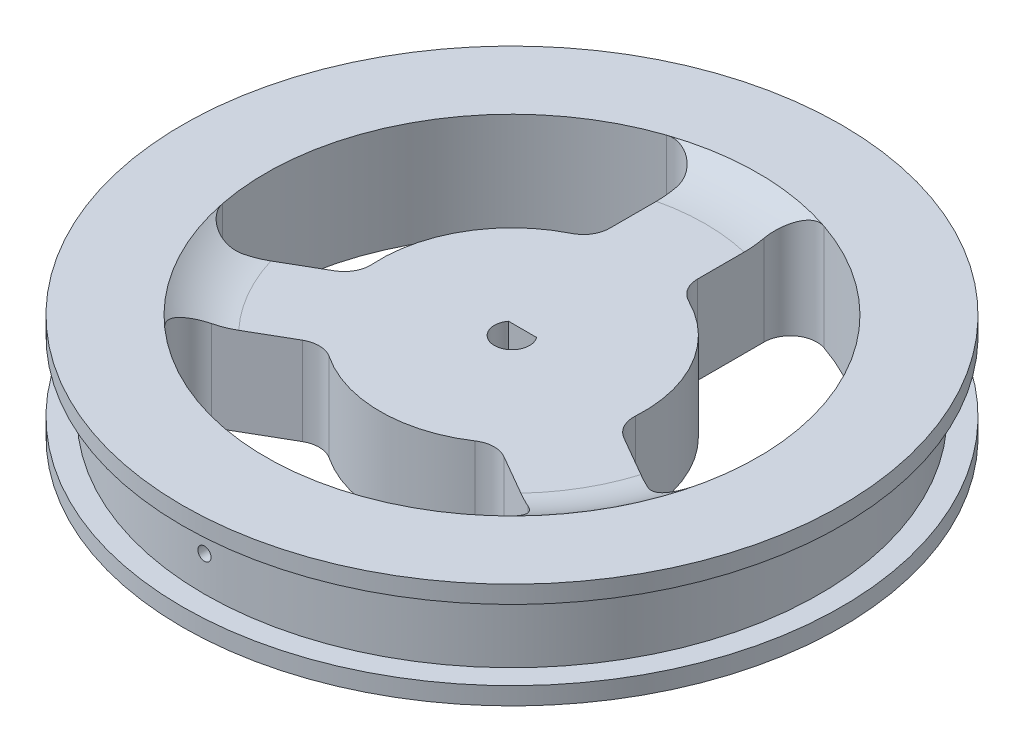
ISO-10303-21;
HEADER;
FILE_DESCRIPTION(('STEP AP214'),'2;1');
FILE_NAME('part.step','',(''),(''),'','','');
FILE_SCHEMA(('AUTOMOTIVE_DESIGN { 1 0 10303 214 1 1 1 1 }'));
ENDSEC;
DATA;
#1=APPLICATION_CONTEXT('core data for automotive mechanical design processes');
#2=APPLICATION_PROTOCOL_DEFINITION('international standard','automotive_design',2000,#1);
#3=PRODUCT_CONTEXT('',#1,'mechanical');
#4=PRODUCT('Part','Part','',(#3));
#5=PRODUCT_RELATED_PRODUCT_CATEGORY('part','',(#4));
#6=PRODUCT_DEFINITION_FORMATION('','',#4);
#7=PRODUCT_DEFINITION_CONTEXT('part definition',#1,'design');
#8=PRODUCT_DEFINITION('design','',#6,#7);
#9=PRODUCT_DEFINITION_SHAPE('','',#8);
#10=(LENGTH_UNIT() NAMED_UNIT(*) SI_UNIT(.MILLI.,.METRE.));
#11=(NAMED_UNIT(*) PLANE_ANGLE_UNIT() SI_UNIT($,.RADIAN.));
#12=(NAMED_UNIT(*) SI_UNIT($,.STERADIAN.) SOLID_ANGLE_UNIT());
#13=UNCERTAINTY_MEASURE_WITH_UNIT(LENGTH_MEASURE(1.E-05),#10,'distance_accuracy_value','');
#14=(GEOMETRIC_REPRESENTATION_CONTEXT(3) GLOBAL_UNCERTAINTY_ASSIGNED_CONTEXT((#13)) GLOBAL_UNIT_ASSIGNED_CONTEXT((#10,
#11,#12)) REPRESENTATION_CONTEXT('',''));
#15=CARTESIAN_POINT('',(0.,0.,0.));
#16=DIRECTION('',(0.,0.,1.));
#17=DIRECTION('',(1.,0.,0.));
#18=AXIS2_PLACEMENT_3D('',#15,#16,#17);
#19=CARTESIAN_POINT('',(0.,0.,0.));
#20=DIRECTION('',(0.,1.,0.));
#21=DIRECTION('',(0.,0.,1.));
#22=AXIS2_PLACEMENT_3D('',#19,#20,#21);
#23=CYLINDRICAL_SURFACE('',#22,28.);
#24=DIRECTION('',(0.,1.,0.));
#25=VECTOR('',#24,1.);
#26=CARTESIAN_POINT('',(-8.96,0.,-26.5276911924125));
#27=LINE('',#26,#25);
#28=CARTESIAN_POINT('',(-8.96,0.,-26.5276911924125));
#29=VERTEX_POINT('',#28);
#30=CARTESIAN_POINT('',(-8.96,12.,-26.5276911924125));
#31=VERTEX_POINT('',#30);
#32=EDGE_CURVE('E286',#29,#31,#27,.T.);
#33=ORIENTED_EDGE('',*,*,#32,.T.);
#34=CARTESIAN_POINT('',(0.,12.,0.));
#35=DIRECTION('',(0.,1.,0.));
#36=DIRECTION('',(0.,0.,1.));
#37=AXIS2_PLACEMENT_3D('',#34,#35,#36);
#38=CIRCLE('',#37,28.);
#39=CARTESIAN_POINT('',(-27.4536544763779,12.,5.50425797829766));
#40=VERTEX_POINT('',#39);
#41=EDGE_CURVE('E258',#31,#40,#38,.T.);
#42=ORIENTED_EDGE('',*,*,#41,.T.);
#43=DIRECTION('',(0.,1.,0.));
#44=VECTOR('',#43,1.);
#45=CARTESIAN_POINT('',(-27.4536544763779,0.,5.50425797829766));
#46=LINE('',#45,#44);
#47=CARTESIAN_POINT('',(-27.4536544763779,0.,5.50425797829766));
#48=VERTEX_POINT('',#47);
#49=EDGE_CURVE('E284',#48,#40,#46,.T.);
#50=ORIENTED_EDGE('',*,*,#49,.F.);
#51=CARTESIAN_POINT('',(0.,0.,0.));
#52=DIRECTION('',(0.,1.,0.));
#53=DIRECTION('',(0.,0.,1.));
#54=AXIS2_PLACEMENT_3D('',#51,#52,#53);
#55=CIRCLE('',#54,28.);
#56=EDGE_CURVE('E952',#29,#48,#55,.T.);
#57=ORIENTED_EDGE('',*,*,#56,.F.);
#58=EDGE_LOOP('',(#33,#42,#50,#57));
#59=FACE_BOUND('',#58,.T.);
#60=ADVANCED_FACE('F35',(#59),#23,.F.);
#61=CARTESIAN_POINT('',(27.4536544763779,12.,5.50425797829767));
#62=VERTEX_POINT('',#61);
#63=CARTESIAN_POINT('',(8.96,12.,-26.5276911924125));
#64=VERTEX_POINT('',#63);
#65=EDGE_CURVE('E262',#62,#64,#38,.T.);
#66=ORIENTED_EDGE('',*,*,#65,.T.);
#67=DIRECTION('',(0.,1.,0.));
#68=VECTOR('',#67,1.);
#69=CARTESIAN_POINT('',(8.96,0.,-26.5276911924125));
#70=LINE('',#69,#68);
#71=CARTESIAN_POINT('',(8.96,0.,-26.5276911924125));
#72=VERTEX_POINT('',#71);
#73=EDGE_CURVE('E523',#72,#64,#70,.T.);
#74=ORIENTED_EDGE('',*,*,#73,.F.);
#75=CARTESIAN_POINT('',(0.,0.,0.));
#76=DIRECTION('',(0.,1.,0.));
#77=DIRECTION('',(0.,0.,1.));
#78=AXIS2_PLACEMENT_3D('',#75,#76,#77);
#79=CIRCLE('',#78,28.);
#80=CARTESIAN_POINT('',(27.4536544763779,0.,5.50425797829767));
#81=VERTEX_POINT('',#80);
#82=EDGE_CURVE('E978',#81,#72,#79,.T.);
#83=ORIENTED_EDGE('',*,*,#82,.F.);
#84=DIRECTION('',(0.,1.,0.));
#85=VECTOR('',#84,1.);
#86=CARTESIAN_POINT('',(27.4536544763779,0.,5.50425797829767));
#87=LINE('',#86,#85);
#88=EDGE_CURVE('E521',#81,#62,#87,.T.);
#89=ORIENTED_EDGE('',*,*,#88,.T.);
#90=EDGE_LOOP('',(#66,#74,#83,#89));
#91=FACE_BOUND('',#90,.T.);
#92=ADVANCED_FACE('F385',(#91),#23,.F.);
#93=CARTESIAN_POINT('',(0.,0.,0.));
#94=DIRECTION('',(0.,-1.,0.));
#95=DIRECTION('',(0.,0.,-1.));
#96=AXIS2_PLACEMENT_3D('',#93,#94,#95);
#97=CYLINDRICAL_SURFACE('',#96,2.);
#98=DIRECTION('',(0.,1.,0.));
#99=VECTOR('',#98,1.);
#100=CARTESIAN_POINT('',(1.6,2.,-1.2));
#101=LINE('',#100,#99);
#102=CARTESIAN_POINT('',(1.6,0.,-1.2));
#103=VERTEX_POINT('',#102);
#104=CARTESIAN_POINT('',(1.6,10.,-1.2));
#105=VERTEX_POINT('',#104);
#106=EDGE_CURVE('E235',#103,#105,#101,.T.);
#107=ORIENTED_EDGE('',*,*,#106,.F.);
#108=CARTESIAN_POINT('',(0.,0.,0.));
#109=DIRECTION('',(0.,1.,0.));
#110=DIRECTION('',(0.,0.,1.));
#111=AXIS2_PLACEMENT_3D('',#108,#109,#110);
#112=CIRCLE('',#111,2.);
#113=CARTESIAN_POINT('',(-1.6,0.,-1.2));
#114=VERTEX_POINT('',#113);
#115=EDGE_CURVE('E40',#114,#103,#112,.T.);
#116=ORIENTED_EDGE('',*,*,#115,.F.);
#117=DIRECTION('',(0.,1.,0.));
#118=VECTOR('',#117,1.);
#119=CARTESIAN_POINT('',(-1.6,2.,-1.2));
#120=LINE('',#119,#118);
#121=CARTESIAN_POINT('',(-1.6,10.,-1.2));
#122=VERTEX_POINT('',#121);
#123=EDGE_CURVE('E54',#114,#122,#120,.T.);
#124=ORIENTED_EDGE('',*,*,#123,.T.);
#125=CARTESIAN_POINT('',(0.,10.,0.));
#126=DIRECTION('',(0.,-1.,0.));
#127=DIRECTION('',(0.,0.,-1.));
#128=AXIS2_PLACEMENT_3D('',#125,#126,#127);
#129=CIRCLE('',#128,2.);
#130=EDGE_CURVE('E240',#105,#122,#129,.T.);
#131=ORIENTED_EDGE('',*,*,#130,.F.);
#132=EDGE_LOOP('',(#107,#116,#124,#131));
#133=FACE_BOUND('',#132,.T.);
#134=ADVANCED_FACE('F236',(#133),#97,.F.);
#135=CARTESIAN_POINT('',(-2.,0.,0.));
#136=DIRECTION('',(0.,1.,0.));
#137=DIRECTION('',(0.,0.,1.));
#138=AXIS2_PLACEMENT_3D('',#135,#136,#137);
#139=PLANE('',#138);
#140=DIRECTION('',(1.,0.,0.));
#141=VECTOR('',#140,1.);
#142=CARTESIAN_POINT('',(-2.,0.,-1.2));
#143=LINE('',#142,#141);
#144=EDGE_CURVE('E244',#103,#114,#143,.F.);
#145=ORIENTED_EDGE('',*,*,#144,.T.);
#146=ORIENTED_EDGE('',*,*,#115,.T.);
#147=EDGE_LOOP('',(#145,#146));
#148=FACE_BOUND('',#147,.T.);
#149=ORIENTED_EDGE('',*,*,#56,.T.);
#150=CARTESIAN_POINT('',(-24.512191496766,0.,4.9145160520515));
#151=DIRECTION('',(0.,1.,0.));
#152=DIRECTION('',(0.,0.,-1.));
#153=AXIS2_PLACEMENT_3D('',#150,#151,#152);
#154=CIRCLE('',#153,3.);
#155=CARTESIAN_POINT('',(-23.012191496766,0.,7.51259226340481));
#156=VERTEX_POINT('',#155);
#157=EDGE_CURVE('E963',#48,#156,#154,.T.);
#158=ORIENTED_EDGE('',*,*,#157,.T.);
#159=DIRECTION('',(0.866025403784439,0.,-0.5));
#160=VECTOR('',#159,1.);
#161=CARTESIAN_POINT('',(-23.012191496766,0.,7.51259226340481));
#162=LINE('',#161,#160);
#163=CARTESIAN_POINT('',(-16.4642400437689,0.,3.73213072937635));
#164=VERTEX_POINT('',#163);
#165=EDGE_CURVE('E1038',#156,#164,#162,.T.);
#166=ORIENTED_EDGE('',*,*,#165,.T.);
#167=CARTESIAN_POINT('',(-17.9642400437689,0.,1.13405451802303));
#168=DIRECTION('',(0.,1.,0.));
#169=DIRECTION('',(0.,0.,1.));
#170=AXIS2_PLACEMENT_3D('',#167,#168,#169);
#171=CIRCLE('',#170,3.);
#172=CARTESIAN_POINT('',(-14.9702000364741,0.,0.945045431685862));
#173=VERTEX_POINT('',#172);
#174=EDGE_CURVE('E1035',#164,#173,#171,.T.);
#175=ORIENTED_EDGE('',*,*,#174,.T.);
#176=CARTESIAN_POINT('',(0.,0.,0.));
#177=DIRECTION('',(0.,-1.,0.));
#178=DIRECTION('',(0.,0.,1.));
#179=AXIS2_PLACEMENT_3D('',#176,#177,#178);
#180=CIRCLE('',#179,15.);
#181=CARTESIAN_POINT('',(-6.66666666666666,0.,-13.4370962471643));
#182=VERTEX_POINT('',#181);
#183=EDGE_CURVE('E1033',#173,#182,#180,.T.);
#184=ORIENTED_EDGE('',*,*,#183,.T.);
#185=CARTESIAN_POINT('',(-8.,0.,-16.1245154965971));
#186=DIRECTION('',(0.,1.,0.));
#187=DIRECTION('',(0.,0.,-1.));
#188=AXIS2_PLACEMENT_3D('',#185,#186,#187);
#189=CIRCLE('',#188,3.);
#190=CARTESIAN_POINT('',(-5.,0.,-16.1245154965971));
#191=VERTEX_POINT('',#190);
#192=EDGE_CURVE('E1047',#182,#191,#189,.T.);
#193=ORIENTED_EDGE('',*,*,#192,.T.);
#194=DIRECTION('',(0.,0.,-1.));
#195=VECTOR('',#194,1.);
#196=CARTESIAN_POINT('',(-5.,0.,-23.685438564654));
#197=LINE('',#196,#195);
#198=CARTESIAN_POINT('',(-5.,0.,-23.685438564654));
#199=VERTEX_POINT('',#198);
#200=EDGE_CURVE('E1028',#191,#199,#197,.T.);
#201=ORIENTED_EDGE('',*,*,#200,.T.);
#202=CARTESIAN_POINT('',(-8.,0.,-23.685438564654));
#203=DIRECTION('',(0.,1.,0.));
#204=DIRECTION('',(0.,0.,1.));
#205=AXIS2_PLACEMENT_3D('',#202,#203,#204);
#206=CIRCLE('',#205,3.);
#207=EDGE_CURVE('E1049',#199,#29,#206,.T.);
#208=ORIENTED_EDGE('',*,*,#207,.T.);
#209=EDGE_LOOP('',(#149,#158,#166,#175,#184,#193,#201,#208));
#210=FACE_BOUND('',#209,.T.);
#211=DIRECTION('',(0.866025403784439,0.,0.5));
#212=VECTOR('',#211,1.);
#213=CARTESIAN_POINT('',(23.012191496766,0.,7.51259226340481));
#214=LINE('',#213,#212);
#215=CARTESIAN_POINT('',(16.4642400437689,0.,3.73213072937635));
#216=VERTEX_POINT('',#215);
#217=CARTESIAN_POINT('',(23.012191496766,0.,7.51259226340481));
#218=VERTEX_POINT('',#217);
#219=EDGE_CURVE('E524',#216,#218,#214,.T.);
#220=ORIENTED_EDGE('',*,*,#219,.T.);
#221=CARTESIAN_POINT('',(24.512191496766,0.,4.9145160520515));
#222=DIRECTION('',(0.,1.,0.));
#223=DIRECTION('',(0.,0.,1.));
#224=AXIS2_PLACEMENT_3D('',#221,#222,#223);
#225=CIRCLE('',#224,3.);
#226=EDGE_CURVE('E975',#218,#81,#225,.T.);
#227=ORIENTED_EDGE('',*,*,#226,.T.);
#228=ORIENTED_EDGE('',*,*,#82,.T.);
#229=CARTESIAN_POINT('',(8.,0.,-23.685438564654));
#230=DIRECTION('',(0.,1.,0.));
#231=DIRECTION('',(0.,0.,-1.));
#232=AXIS2_PLACEMENT_3D('',#229,#230,#231);
#233=CIRCLE('',#232,3.);
#234=CARTESIAN_POINT('',(5.,0.,-23.685438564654));
#235=VERTEX_POINT('',#234);
#236=EDGE_CURVE('E982',#72,#235,#233,.T.);
#237=ORIENTED_EDGE('',*,*,#236,.T.);
#238=DIRECTION('',(0.,0.,1.));
#239=VECTOR('',#238,1.);
#240=CARTESIAN_POINT('',(5.,0.,-23.685438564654));
#241=LINE('',#240,#239);
#242=CARTESIAN_POINT('',(5.,0.,-16.1245154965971));
#243=VERTEX_POINT('',#242);
#244=EDGE_CURVE('E985',#235,#243,#241,.T.);
#245=ORIENTED_EDGE('',*,*,#244,.T.);
#246=CARTESIAN_POINT('',(8.,0.,-16.1245154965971));
#247=DIRECTION('',(0.,1.,0.));
#248=DIRECTION('',(0.,0.,1.));
#249=AXIS2_PLACEMENT_3D('',#246,#247,#248);
#250=CIRCLE('',#249,3.);
#251=CARTESIAN_POINT('',(6.66666666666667,0.,-13.4370962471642));
#252=VERTEX_POINT('',#251);
#253=EDGE_CURVE('E988',#243,#252,#250,.T.);
#254=ORIENTED_EDGE('',*,*,#253,.T.);
#255=CARTESIAN_POINT('',(0.,0.,0.));
#256=DIRECTION('',(0.,-1.,0.));
#257=DIRECTION('',(0.,0.,1.));
#258=AXIS2_PLACEMENT_3D('',#255,#256,#257);
#259=CIRCLE('',#258,15.);
#260=CARTESIAN_POINT('',(14.9702000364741,0.,0.945045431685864));
#261=VERTEX_POINT('',#260);
#262=EDGE_CURVE('E991',#252,#261,#259,.T.);
#263=ORIENTED_EDGE('',*,*,#262,.T.);
#264=CARTESIAN_POINT('',(17.9642400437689,0.,1.13405451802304));
#265=DIRECTION('',(0.,1.,0.));
#266=DIRECTION('',(0.,0.,-1.));
#267=AXIS2_PLACEMENT_3D('',#264,#265,#266);
#268=CIRCLE('',#267,3.);
#269=EDGE_CURVE('E994',#261,#216,#268,.T.);
#270=ORIENTED_EDGE('',*,*,#269,.T.);
#271=EDGE_LOOP('',(#220,#227,#228,#237,#245,#254,#263,#270));
#272=FACE_BOUND('',#271,.T.);
#273=CARTESIAN_POINT('',(0.,0.,0.));
#274=DIRECTION('',(0.,1.,0.));
#275=DIRECTION('',(0.,0.,1.));
#276=AXIS2_PLACEMENT_3D('',#273,#274,#275);
#277=CIRCLE('',#276,28.);
#278=CARTESIAN_POINT('',(-18.4936544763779,0.,21.0234332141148));
#279=VERTEX_POINT('',#278);
#280=CARTESIAN_POINT('',(18.4936544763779,0.,21.0234332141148));
#281=VERTEX_POINT('',#280);
#282=EDGE_CURVE('E894',#279,#281,#277,.T.);
#283=ORIENTED_EDGE('',*,*,#282,.T.);
#284=CARTESIAN_POINT('',(16.512191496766,0.,18.7709225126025));
#285=DIRECTION('',(0.,1.,0.));
#286=DIRECTION('',(0.,0.,-1.));
#287=AXIS2_PLACEMENT_3D('',#284,#285,#286);
#288=CIRCLE('',#287,3.);
#289=CARTESIAN_POINT('',(18.012191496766,0.,16.1728463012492));
#290=VERTEX_POINT('',#289);
#291=EDGE_CURVE('E891',#281,#290,#288,.T.);
#292=ORIENTED_EDGE('',*,*,#291,.T.);
#293=DIRECTION('',(-0.866025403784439,0.,-0.5));
#294=VECTOR('',#293,1.);
#295=CARTESIAN_POINT('',(18.012191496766,0.,16.1728463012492));
#296=LINE('',#295,#294);
#297=CARTESIAN_POINT('',(11.4642400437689,0.,12.3923847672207));
#298=VERTEX_POINT('',#297);
#299=EDGE_CURVE('E896',#290,#298,#296,.T.);
#300=ORIENTED_EDGE('',*,*,#299,.T.);
#301=CARTESIAN_POINT('',(9.96424004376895,0.,14.9904609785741));
#302=DIRECTION('',(0.,1.,0.));
#303=DIRECTION('',(0.,0.,1.));
#304=AXIS2_PLACEMENT_3D('',#301,#302,#303);
#305=CIRCLE('',#304,3.);
#306=CARTESIAN_POINT('',(8.30353336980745,0.,12.4920508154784));
#307=VERTEX_POINT('',#306);
#308=EDGE_CURVE('E899',#298,#307,#305,.T.);
#309=ORIENTED_EDGE('',*,*,#308,.T.);
#310=CARTESIAN_POINT('',(0.,0.,0.));
#311=DIRECTION('',(0.,-1.,0.));
#312=DIRECTION('',(0.,0.,1.));
#313=AXIS2_PLACEMENT_3D('',#310,#311,#312);
#314=CIRCLE('',#313,15.);
#315=CARTESIAN_POINT('',(-8.30353336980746,0.,12.4920508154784));
#316=VERTEX_POINT('',#315);
#317=EDGE_CURVE('E911',#307,#316,#314,.T.);
#318=ORIENTED_EDGE('',*,*,#317,.T.);
#319=CARTESIAN_POINT('',(-9.96424004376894,0.,14.9904609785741));
#320=DIRECTION('',(0.,1.,0.));
#321=DIRECTION('',(0.,0.,-1.));
#322=AXIS2_PLACEMENT_3D('',#319,#320,#321);
#323=CIRCLE('',#322,3.);
#324=CARTESIAN_POINT('',(-11.4642400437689,0.,12.3923847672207));
#325=VERTEX_POINT('',#324);
#326=EDGE_CURVE('E914',#316,#325,#323,.T.);
#327=ORIENTED_EDGE('',*,*,#326,.T.);
#328=DIRECTION('',(-0.866025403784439,0.,0.5));
#329=VECTOR('',#328,1.);
#330=CARTESIAN_POINT('',(-18.012191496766,0.,16.1728463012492));
#331=LINE('',#330,#329);
#332=CARTESIAN_POINT('',(-18.012191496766,0.,16.1728463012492));
#333=VERTEX_POINT('',#332);
#334=EDGE_CURVE('E917',#325,#333,#331,.T.);
#335=ORIENTED_EDGE('',*,*,#334,.T.);
#336=CARTESIAN_POINT('',(-16.512191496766,0.,18.7709225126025));
#337=DIRECTION('',(0.,1.,0.));
#338=DIRECTION('',(0.,0.,1.));
#339=AXIS2_PLACEMENT_3D('',#336,#337,#338);
#340=CIRCLE('',#339,3.);
#341=EDGE_CURVE('E920',#333,#279,#340,.T.);
#342=ORIENTED_EDGE('',*,*,#341,.T.);
#343=EDGE_LOOP('',(#283,#292,#300,#309,#318,#327,#335,#342));
#344=FACE_BOUND('',#343,.T.);
#345=CARTESIAN_POINT('',(0.,0.,0.));
#346=DIRECTION('',(0.,-1.,0.));
#347=DIRECTION('',(0.,0.,-1.));
#348=AXIS2_PLACEMENT_3D('',#345,#346,#347);
#349=CIRCLE('',#348,37.5);
#350=CARTESIAN_POINT('',(0.,0.,-37.5));
#351=VERTEX_POINT('',#350);
#352=EDGE_CURVE('E516',#351,#351,#349,.T.);
#353=ORIENTED_EDGE('',*,*,#352,.T.);
#354=EDGE_LOOP('',(#353));
#355=FACE_BOUND('',#354,.T.);
#356=ADVANCED_FACE('F247',(#148,#210,#272,#344,#355),#139,.F.);
#357=CARTESIAN_POINT('',(0.,0.,0.));
#358=DIRECTION('',(0.,-1.,0.));
#359=DIRECTION('',(0.,0.,-1.));
#360=AXIS2_PLACEMENT_3D('',#357,#358,#359);
#361=CYLINDRICAL_SURFACE('',#360,37.5);
#362=ORIENTED_EDGE('',*,*,#352,.F.);
#363=EDGE_LOOP('',(#362));
#364=FACE_BOUND('',#363,.T.);
#365=CARTESIAN_POINT('',(0.,1.99999999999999,0.));
#366=DIRECTION('',(0.,-1.,0.));
#367=DIRECTION('',(0.,0.,-1.));
#368=AXIS2_PLACEMENT_3D('',#365,#366,#367);
#369=CIRCLE('',#368,37.5);
#370=CARTESIAN_POINT('',(0.,1.99999999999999,-37.5));
#371=VERTEX_POINT('',#370);
#372=EDGE_CURVE('E548',#371,#371,#369,.T.);
#373=ORIENTED_EDGE('',*,*,#372,.T.);
#374=EDGE_LOOP('',(#373));
#375=FACE_BOUND('',#374,.T.);
#376=ADVANCED_FACE('F558',(#364,#375),#361,.T.);
#377=CARTESIAN_POINT('',(-37.5,1.99999999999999,0.));
#378=DIRECTION('',(0.,-1.,0.));
#379=DIRECTION('',(0.,0.,-1.));
#380=AXIS2_PLACEMENT_3D('',#377,#378,#379);
#381=PLANE('',#380);
#382=ORIENTED_EDGE('',*,*,#372,.F.);
#383=EDGE_LOOP('',(#382));
#384=FACE_BOUND('',#383,.T.);
#385=CARTESIAN_POINT('',(0.,1.99999999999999,0.));
#386=DIRECTION('',(0.,-1.,0.));
#387=DIRECTION('',(0.,0.,-1.));
#388=AXIS2_PLACEMENT_3D('',#385,#386,#387);
#389=CIRCLE('',#388,35.);
#390=CARTESIAN_POINT('',(0.,1.99999999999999,-35.));
#391=VERTEX_POINT('',#390);
#392=EDGE_CURVE('E545',#391,#391,#389,.T.);
#393=ORIENTED_EDGE('',*,*,#392,.T.);
#394=EDGE_LOOP('',(#393));
#395=FACE_BOUND('',#394,.T.);
#396=ADVANCED_FACE('F393',(#384,#395),#381,.F.);
#397=CARTESIAN_POINT('',(0.,0.,0.));
#398=DIRECTION('',(0.,-1.,0.));
#399=DIRECTION('',(0.,0.,-1.));
#400=AXIS2_PLACEMENT_3D('',#397,#398,#399);
#401=CYLINDRICAL_SURFACE('',#400,35.);
#402=CARTESIAN_POINT('',(0.,5.24999999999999,35.));
#403=CARTESIAN_POINT('',(0.0122583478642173,5.24999971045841,34.9999998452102));
#404=CARTESIAN_POINT('',(0.0245168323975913,5.2503005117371,34.9999901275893));
#405=CARTESIAN_POINT('',(0.0497464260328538,5.25153878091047,34.9999530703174));
#406=CARTESIAN_POINT('',(0.0627157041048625,5.25251372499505,34.9999246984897));
#407=CARTESIAN_POINT('',(0.0893250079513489,5.25521144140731,34.9998503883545));
#408=CARTESIAN_POINT('',(0.102961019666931,5.25697375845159,34.9998035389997));
#409=CARTESIAN_POINT('',(0.13085043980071,5.26136070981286,34.9996921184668));
#410=CARTESIAN_POINT('',(0.145097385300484,5.26402680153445,34.9996267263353));
#411=CARTESIAN_POINT('',(0.166604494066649,5.26870008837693,34.9995166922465));
#412=CARTESIAN_POINT('',(0.173931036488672,5.27040792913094,34.9994771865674));
#413=CARTESIAN_POINT('',(0.188709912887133,5.27408818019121,34.9993936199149));
#414=CARTESIAN_POINT('',(0.196160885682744,5.27606608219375,34.9993494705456));
#415=CARTESIAN_POINT('',(0.211177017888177,5.28030104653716,34.9992566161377));
#416=CARTESIAN_POINT('',(0.218740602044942,5.28256368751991,34.9992078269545));
#417=CARTESIAN_POINT('',(0.233969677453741,5.28738266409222,34.9991056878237));
#418=CARTESIAN_POINT('',(0.241633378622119,5.28994465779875,34.9990522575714));
#419=CARTESIAN_POINT('',(0.257049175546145,5.2953766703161,34.9989408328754));
#420=CARTESIAN_POINT('',(0.264799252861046,5.29825241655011,34.9988827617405));
#421=CARTESIAN_POINT('',(0.280373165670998,5.30432600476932,34.9987620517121));
#422=CARTESIAN_POINT('',(0.288194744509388,5.30752963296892,34.9986993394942));
#423=CARTESIAN_POINT('',(0.303895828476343,5.31427270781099,34.9985693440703));
#424=CARTESIAN_POINT('',(0.311772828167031,5.31781798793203,34.9985019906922));
#425=CARTESIAN_POINT('',(0.327567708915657,5.32525765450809,34.9983627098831));
#426=CARTESIAN_POINT('',(0.33548282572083,5.32915790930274,34.9982907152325));
#427=CARTESIAN_POINT('',(0.351347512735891,5.33732638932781,34.9981420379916));
#428=CARTESIAN_POINT('',(0.359293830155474,5.34160093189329,34.9980652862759));
#429=CARTESIAN_POINT('',(0.375189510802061,5.35052512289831,34.9979071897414));
#430=CARTESIAN_POINT('',(0.383135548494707,5.35518069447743,34.997825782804));
#431=CARTESIAN_POINT('',(0.399009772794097,5.36487839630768,34.9976583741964));
#432=CARTESIAN_POINT('',(0.406934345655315,5.36992644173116,34.9975723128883));
#433=CARTESIAN_POINT('',(0.422743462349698,5.38041969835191,34.9973955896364));
#434=CARTESIAN_POINT('',(0.430624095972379,5.38587080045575,34.9973048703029));
#435=CARTESIAN_POINT('',(0.446321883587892,5.39717982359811,34.9971188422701));
#436=CARTESIAN_POINT('',(0.454134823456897,5.403043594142,34.9970234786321));
#437=CARTESIAN_POINT('',(0.469672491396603,5.41518651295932,34.9968281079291));
#438=CARTESIAN_POINT('',(0.477392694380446,5.42147145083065,34.9967280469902));
#439=CARTESIAN_POINT('',(0.492718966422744,5.43446412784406,34.996523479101));
#440=CARTESIAN_POINT('',(0.500320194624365,5.44117757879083,34.9964189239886));
#441=CARTESIAN_POINT('',(0.515381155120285,5.45503312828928,34.9962046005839));
#442=CARTESIAN_POINT('',(0.522835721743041,5.46218083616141,34.996094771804));
#443=CARTESIAN_POINT('',(0.539686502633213,5.47901957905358,34.9958410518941));
#444=CARTESIAN_POINT('',(0.54897612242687,5.48881768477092,34.9956970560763));
#445=CARTESIAN_POINT('',(0.56670391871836,5.50855663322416,34.9954175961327));
#446=CARTESIAN_POINT('',(0.575160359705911,5.51848109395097,34.9952820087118));
#447=CARTESIAN_POINT('',(0.591254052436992,5.53839768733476,34.9950183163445));
#448=CARTESIAN_POINT('',(0.59890972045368,5.54837493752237,34.9948901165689));
#449=CARTESIAN_POINT('',(0.613437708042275,5.5683278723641,34.9946414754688));
#450=CARTESIAN_POINT('',(0.620328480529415,5.57829012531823,34.9945209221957));
#451=CARTESIAN_POINT('',(0.633365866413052,5.59815010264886,34.994287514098));
#452=CARTESIAN_POINT('',(0.63953084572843,5.60803577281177,34.9941745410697));
#453=CARTESIAN_POINT('',(0.651158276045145,5.62768561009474,34.9939563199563));
#454=CARTESIAN_POINT('',(0.656638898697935,5.63743902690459,34.993850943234));
#455=CARTESIAN_POINT('',(0.666941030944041,5.65677319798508,34.9936479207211));
#456=CARTESIAN_POINT('',(0.671780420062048,5.66634442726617,34.9935501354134));
#457=CARTESIAN_POINT('',(0.680844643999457,5.68526861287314,34.9933623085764));
#458=CARTESIAN_POINT('',(0.685086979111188,5.69461318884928,34.9932721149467));
#459=CARTESIAN_POINT('',(0.693007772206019,5.71305661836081,34.9930993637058));
#460=CARTESIAN_POINT('',(0.696702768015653,5.72214837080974,34.99301664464));
#461=CARTESIAN_POINT('',(0.7035670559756,5.74003694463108,34.992859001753));
#462=CARTESIAN_POINT('',(0.706752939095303,5.74882740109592,34.992783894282));
#463=CARTESIAN_POINT('',(0.712644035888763,5.76608246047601,34.992641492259));
#464=CARTESIAN_POINT('',(0.715365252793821,5.77454160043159,34.9925739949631));
#465=CARTESIAN_POINT('',(0.720371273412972,5.7911073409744,34.9924468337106));
#466=CARTESIAN_POINT('',(0.722671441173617,5.79920930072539,34.9923869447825));
#467=CARTESIAN_POINT('',(0.726878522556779,5.81503803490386,34.9922750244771));
#468=CARTESIAN_POINT('',(0.728800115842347,5.8227609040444,34.9922227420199));
#469=CARTESIAN_POINT('',(0.732291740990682,5.8378119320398,34.9921260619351));
#470=CARTESIAN_POINT('',(0.733875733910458,5.84513686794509,34.9920813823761));
#471=CARTESIAN_POINT('',(0.738023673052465,5.86581413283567,34.9919631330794));
#472=CARTESIAN_POINT('',(0.740335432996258,5.87921810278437,34.9918956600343));
#473=CARTESIAN_POINT('',(0.743965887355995,5.90432658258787,34.9917932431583));
#474=CARTESIAN_POINT('',(0.745376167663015,5.91601801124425,34.991755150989));
#475=CARTESIAN_POINT('',(0.747465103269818,5.93759749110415,34.9917151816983));
#476=CARTESIAN_POINT('',(0.748224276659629,5.9474777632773,34.9917085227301));
#477=CARTESIAN_POINT('',(0.749244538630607,5.96539803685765,34.9917258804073));
#478=CARTESIAN_POINT('',(0.749572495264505,5.97343426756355,34.9917443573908));
#479=CARTESIAN_POINT('',(0.749923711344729,5.98764781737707,34.9918334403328));
#480=CARTESIAN_POINT('',(0.750000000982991,5.99382395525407,34.9918909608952));
#481=CARTESIAN_POINT('',(0.749999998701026,6.00816133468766,34.9920590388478));
#482=CARTESIAN_POINT('',(0.749866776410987,6.016322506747,34.9921807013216));
#483=CARTESIAN_POINT('',(0.749334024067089,6.03263624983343,34.9924071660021));
#484=CARTESIAN_POINT('',(0.748934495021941,6.04078882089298,34.9925119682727));
#485=CARTESIAN_POINT('',(0.747869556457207,6.0570765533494,34.9927231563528));
#486=CARTESIAN_POINT('',(0.74720414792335,6.0652117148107,34.9928295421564));
#487=CARTESIAN_POINT('',(0.745608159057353,6.081455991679,34.993038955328));
#488=CARTESIAN_POINT('',(0.744677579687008,6.08956510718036,34.9931419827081));
#489=CARTESIAN_POINT('',(0.742552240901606,6.10574864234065,34.993346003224));
#490=CARTESIAN_POINT('',(0.74135748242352,6.11382306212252,34.9934469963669));
#491=CARTESIAN_POINT('',(0.738705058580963,6.12992860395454,34.9936465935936));
#492=CARTESIAN_POINT('',(0.737247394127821,6.13795972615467,34.9937451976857));
#493=CARTESIAN_POINT('',(0.734070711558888,6.15397011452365,34.9939401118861));
#494=CARTESIAN_POINT('',(0.732351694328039,6.16194938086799,34.9940364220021));
#495=CARTESIAN_POINT('',(0.728654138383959,6.17784755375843,34.9942267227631));
#496=CARTESIAN_POINT('',(0.726675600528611,6.18576646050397,34.9943207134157));
#497=CARTESIAN_POINT('',(0.722454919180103,6.20155864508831,34.994506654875));
#498=CARTESIAN_POINT('',(0.720212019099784,6.20943172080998,34.9945985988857));
#499=CARTESIAN_POINT('',(0.715469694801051,6.2251002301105,34.9947801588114));
#500=CARTESIAN_POINT('',(0.712970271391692,6.23289566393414,34.9948697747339));
#501=CARTESIAN_POINT('',(0.707717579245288,6.24840053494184,34.9950466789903));
#502=CARTESIAN_POINT('',(0.704964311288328,6.25610997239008,34.9951339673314));
#503=CARTESIAN_POINT('',(0.69920688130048,6.27143458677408,34.9953062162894));
#504=CARTESIAN_POINT('',(0.696202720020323,6.27904976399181,34.9953911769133));
#505=CARTESIAN_POINT('',(0.689946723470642,6.29417769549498,34.9955587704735));
#506=CARTESIAN_POINT('',(0.68669488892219,6.30169045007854,34.9956414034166));
#507=CARTESIAN_POINT('',(0.679947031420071,6.31660548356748,34.9958043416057));
#508=CARTESIAN_POINT('',(0.676451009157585,6.3240077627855,34.9958846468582));
#509=CARTESIAN_POINT('',(0.669218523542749,6.33869391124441,34.996042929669));
#510=CARTESIAN_POINT('',(0.665482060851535,6.34597778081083,34.9961209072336));
#511=CARTESIAN_POINT('',(0.657772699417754,6.36041930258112,34.9962745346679));
#512=CARTESIAN_POINT('',(0.653799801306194,6.36757695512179,34.9963501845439));
#513=CARTESIAN_POINT('',(0.64562182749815,6.38175837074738,34.9964991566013));
#514=CARTESIAN_POINT('',(0.641416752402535,6.38878213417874,34.9965724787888));
#515=CARTESIAN_POINT('',(0.632778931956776,6.40268824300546,34.9967167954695));
#516=CARTESIAN_POINT('',(0.628346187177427,6.4095705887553,34.9967877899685));
#517=CARTESIAN_POINT('',(0.619257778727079,6.42318648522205,34.9969274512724));
#518=CARTESIAN_POINT('',(0.614602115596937,6.42992003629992,34.9969961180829));
#519=CARTESIAN_POINT('',(0.605072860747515,6.44323112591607,34.99713112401));
#520=CARTESIAN_POINT('',(0.600199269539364,6.44980866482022,34.997197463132));
#521=CARTESIAN_POINT('',(0.590239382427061,6.46280067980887,34.9973278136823));
#522=CARTESIAN_POINT('',(0.585153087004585,6.46921515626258,34.9973918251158));
#523=CARTESIAN_POINT('',(0.574773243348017,6.48187417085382,34.9975175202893));
#524=CARTESIAN_POINT('',(0.569479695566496,6.48811870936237,34.9975792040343));
#525=CARTESIAN_POINT('',(0.55869102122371,6.50043115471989,34.997700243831));
#526=CARTESIAN_POINT('',(0.553195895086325,6.50649906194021,34.9977595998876));
#527=CARTESIAN_POINT('',(0.542009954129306,6.51845174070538,34.9978759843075));
#528=CARTESIAN_POINT('',(0.536319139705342,6.52433651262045,34.9979330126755));
#529=CARTESIAN_POINT('',(0.524747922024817,6.53591661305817,34.9980447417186));
#530=CARTESIAN_POINT('',(0.518867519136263,6.54161194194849,34.9980994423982));
#531=CARTESIAN_POINT('',(0.506923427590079,6.55280705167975,34.9982065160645));
#532=CARTESIAN_POINT('',(0.500859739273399,6.55830683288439,34.9982588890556));
#533=CARTESIAN_POINT('',(0.488555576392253,6.5691049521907,34.9983613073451));
#534=CARTESIAN_POINT('',(0.482315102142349,6.57440329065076,34.9984113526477));
#535=CARTESIAN_POINT('',(0.46966405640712,6.58479284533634,34.9985091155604));
#536=CARTESIAN_POINT('',(0.4632534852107,6.58988406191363,34.9985568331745));
#537=CARTESIAN_POINT('',(0.450269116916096,6.59985391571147,34.9986499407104));
#538=CARTESIAN_POINT('',(0.443695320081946,6.60473255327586,34.998695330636));
#539=CARTESIAN_POINT('',(0.430391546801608,6.61427201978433,34.9987837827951));
#540=CARTESIAN_POINT('',(0.423661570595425,6.61893284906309,34.9988268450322));
#541=CARTESIAN_POINT('',(0.410052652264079,6.62803170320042,34.9989106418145));
#542=CARTESIAN_POINT('',(0.403173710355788,6.63246972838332,34.9989513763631));
#543=CARTESIAN_POINT('',(0.389274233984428,6.64111821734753,34.9990305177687));
#544=CARTESIAN_POINT('',(0.382253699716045,6.64532868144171,34.9990689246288));
#545=CARTESIAN_POINT('',(0.368078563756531,6.65351753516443,34.9991434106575));
#546=CARTESIAN_POINT('',(0.360923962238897,6.65749592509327,34.9991794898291));
#547=CARTESIAN_POINT('',(0.346488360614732,6.665216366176,34.9992493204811));
#548=CARTESIAN_POINT('',(0.339207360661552,6.66895841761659,34.9992830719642));
#549=CARTESIAN_POINT('',(0.324526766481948,6.67620217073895,34.9993482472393));
#550=CARTESIAN_POINT('',(0.317127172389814,6.67970387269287,34.999379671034));
#551=CARTESIAN_POINT('',(0.302217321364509,6.68646317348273,34.9994401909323));
#552=CARTESIAN_POINT('',(0.294707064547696,6.68972077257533,34.9994692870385));
#553=CARTESIAN_POINT('',(0.279583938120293,6.69598837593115,34.99952515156));
#554=CARTESIAN_POINT('',(0.271971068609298,6.69899838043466,34.9995519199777));
#555=CARTESIAN_POINT('',(0.256650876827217,6.70476756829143,34.9996031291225));
#556=CARTESIAN_POINT('',(0.248943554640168,6.70752675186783,34.9996275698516));
#557=CARTESIAN_POINT('',(0.233442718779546,6.71279134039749,34.9996741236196));
#558=CARTESIAN_POINT('',(0.225649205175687,6.71529674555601,34.9996962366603));
#559=CARTESIAN_POINT('',(0.209984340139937,6.72005109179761,34.9997381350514));
#560=CARTESIAN_POINT('',(0.202112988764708,6.72230003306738,34.9997579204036));
#561=CARTESIAN_POINT('',(0.186300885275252,6.72653904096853,34.999795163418));
#562=CARTESIAN_POINT('',(0.178360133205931,6.72852910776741,34.9998126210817));
#563=CARTESIAN_POINT('',(0.162417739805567,6.73224823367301,34.9998452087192));
#564=CARTESIAN_POINT('',(0.154416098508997,6.7339772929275,34.9998603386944));
#565=CARTESIAN_POINT('',(0.138360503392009,6.73717255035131,34.9998882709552));
#566=CARTESIAN_POINT('',(0.130306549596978,6.7386387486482,34.9999010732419));
#567=CARTESIAN_POINT('',(0.114154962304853,6.74130671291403,34.9999243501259));
#568=CARTESIAN_POINT('',(0.106057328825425,6.7425084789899,34.9999348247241));
#569=CARTESIAN_POINT('',(0.0898270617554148,6.7446462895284,34.9999534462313));
#570=CARTESIAN_POINT('',(0.0816944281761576,6.74558233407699,34.999961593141));
#571=CARTESIAN_POINT('',(0.0654028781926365,6.74718770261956,34.9999755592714));
#572=CARTESIAN_POINT('',(0.0572439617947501,6.74785702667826,34.9999813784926));
#573=CARTESIAN_POINT('',(0.0409085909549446,6.74892822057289,34.9999906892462));
#574=CARTESIAN_POINT('',(0.0327321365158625,6.74933009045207,34.9999941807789));
#575=CARTESIAN_POINT('',(0.0163704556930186,6.74986600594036,34.9999988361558));
#576=CARTESIAN_POINT('',(0.00818522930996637,6.75000005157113,35.0000000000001));
#577=CARTESIAN_POINT('',(0.,6.74999999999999,35.));
#578=B_SPLINE_CURVE_WITH_KNOTS('',3,(#402,#403,#404,#405,#406,#407,#408,#409,#410,#411,#412,
#413,#414,#415,#416,#417,#418,#419,#420,#421,#422,#423,#424,#425,#426,#427,#428,#429,#430,#431,
#432,#433,#434,#435,#436,#437,#438,#439,#440,#441,#442,#443,#444,#445,#446,#447,#448,#449,#450,
#451,#452,#453,#454,#455,#456,#457,#458,#459,#460,#461,#462,#463,#464,#465,#466,#467,#468,#469,
#470,#471,#472,#473,#474,#475,#476,#477,#478,#479,#480,#481,#482,#483,#484,#485,#486,#487,#488,
#489,#490,#491,#492,#493,#494,#495,#496,#497,#498,#499,#500,#501,#502,#503,#504,#505,#506,#507,
#508,#509,#510,#511,#512,#513,#514,#515,#516,#517,#518,#519,#520,#521,#522,#523,#524,#525,#526,
#527,#528,#529,#530,#531,#532,#533,#534,#535,#536,#537,#538,#539,#540,#541,#542,#543,#544,#545,
#546,#547,#548,#549,#550,#551,#552,#553,#554,#555,#556,#557,#558,#559,#560,#561,#562,#563,#564,
#565,#566,#567,#568,#569,#570,#571,#572,#573,#574,#575,#576,#577),.UNSPECIFIED.,.F.,.F.,(4,2,2,
2,2,2,2,2,2,2,2,2,2,2,2,2,2,2,2,2,2,2,2,2,2,2,2,2,2,2,2,2,2,2,2,2,2,2,2,2,2,2,2,2,2,2,2,2,2,2,2,
2,2,2,2,2,2,2,2,2,2,2,2,2,2,2,2,2,2,2,2,2,2,2,2,2,2,2,2,2,2,2,2,2,2,2,2,4),(0.,
0.0367717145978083,0.0757717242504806,0.117000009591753,0.160456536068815,0.183022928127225,
0.206146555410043,0.229827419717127,0.254065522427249,0.278860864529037,0.30421344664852,
0.330123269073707,0.356590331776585,0.383654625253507,0.41127779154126,0.43945982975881,
0.468200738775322,0.497500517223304,0.527359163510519,0.557776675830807,0.588753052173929,
0.629240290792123,0.668340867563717,0.706054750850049,0.742381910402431,0.777322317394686,
0.810875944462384,0.843042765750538,0.873822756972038,0.903257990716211,0.931302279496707,
0.957955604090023,0.983217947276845,1.00708929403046,1.02956963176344,1.07035347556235,
1.10566954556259,1.13538988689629,1.15951436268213,1.17804316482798,1.20252805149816,
1.22701284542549,1.25149754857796,1.27598216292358,1.30046669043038,1.32495113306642,
1.34943549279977,1.37391977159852,1.39847590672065,1.42303196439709,1.44758794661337,
1.47214385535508,1.4966996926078,1.52125546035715,1.54581116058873,1.5703667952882,
1.5949223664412,1.61947787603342,1.64403332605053,1.66858871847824,1.69314405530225,
1.7176993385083,1.74225457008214,1.7668097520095,1.79136488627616,1.81591997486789,
1.84047501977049,1.86503002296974,1.88958498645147,1.91413991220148,1.93869480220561,
1.96324965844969,1.98780448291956,2.01235927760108,2.03691404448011,2.06146878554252,
2.08602350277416,2.11057819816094,2.13513287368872,2.15968753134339,2.18424217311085,
2.208796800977,2.23335141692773,2.25790602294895,2.28246062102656,2.30701521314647,
2.33156980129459,2.35612438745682),.UNSPECIFIED.);
#579=CARTESIAN_POINT('',(0.,5.24999999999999,35.));
#580=VERTEX_POINT('',#579);
#581=CARTESIAN_POINT('',(0.,6.74999999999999,35.));
#582=VERTEX_POINT('',#581);
#583=EDGE_CURVE('E229',#580,#582,#578,.T.);
#584=ORIENTED_EDGE('',*,*,#583,.F.);
#585=CARTESIAN_POINT('',(0.,6.74999999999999,35.));
#586=CARTESIAN_POINT('',(-0.0122652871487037,6.75000029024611,34.9999998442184));
#587=CARTESIAN_POINT('',(-0.0245307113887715,6.74969914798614,34.9999901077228));
#588=CARTESIAN_POINT('',(-0.0497763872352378,6.74845938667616,34.9999529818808));
#589=CARTESIAN_POINT('',(-0.0627548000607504,6.74748315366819,34.9999245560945));
#590=CARTESIAN_POINT('',(-0.0893844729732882,6.74478163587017,34.9998501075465));
#591=CARTESIAN_POINT('',(-0.103031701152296,6.74301665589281,34.9998031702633));
#592=CARTESIAN_POINT('',(-0.130945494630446,6.738622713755,34.9996915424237));
#593=CARTESIAN_POINT('',(-0.145205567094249,6.73595213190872,34.9996260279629));
#594=CARTESIAN_POINT('',(-0.16673282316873,6.73127074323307,34.9995157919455));
#595=CARTESIAN_POINT('',(-0.174066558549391,6.72955982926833,34.9994762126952));
#596=CARTESIAN_POINT('',(-0.18886020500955,6.7258728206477,34.9993924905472));
#597=CARTESIAN_POINT('',(-0.196318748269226,6.72389121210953,34.9993482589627));
#598=CARTESIAN_POINT('',(-0.211350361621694,6.71964816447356,34.9992552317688));
#599=CARTESIAN_POINT('',(-0.218921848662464,6.71738112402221,34.9992063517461));
#600=CARTESIAN_POINT('',(-0.234167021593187,6.71255261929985,34.9991040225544));
#601=CARTESIAN_POINT('',(-0.241838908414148,6.70998547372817,34.9990504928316));
#602=CARTESIAN_POINT('',(-0.257271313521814,6.70454237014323,34.9989388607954));
#603=CARTESIAN_POINT('',(-0.265029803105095,6.70166066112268,34.9988806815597));
#604=CARTESIAN_POINT('',(-0.28062071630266,6.69557430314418,34.998759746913));
#605=CARTESIAN_POINT('',(-0.288450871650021,6.69236384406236,34.9986969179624));
#606=CARTESIAN_POINT('',(-0.304169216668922,6.68560620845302,34.9985666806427));
#607=CARTESIAN_POINT('',(-0.312054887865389,6.68205317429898,34.9984992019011));
#608=CARTESIAN_POINT('',(-0.327867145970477,6.67459704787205,34.9983596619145));
#609=CARTESIAN_POINT('',(-0.335790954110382,6.67068806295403,34.998287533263));
#610=CARTESIAN_POINT('',(-0.351661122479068,6.66250722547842,34.9981386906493));
#611=CARTESIAN_POINT('',(-0.359604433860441,6.65822945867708,34.9980619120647));
#612=CARTESIAN_POINT('',(-0.375493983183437,6.64929887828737,34.997903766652));
#613=CARTESIAN_POINT('',(-0.383436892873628,6.64464014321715,34.9978223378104));
#614=CARTESIAN_POINT('',(-0.399304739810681,6.63493618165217,34.9976548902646));
#615=CARTESIAN_POINT('',(-0.407226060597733,6.6298850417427,34.997568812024));
#616=CARTESIAN_POINT('',(-0.423028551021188,6.61938567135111,34.9973920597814));
#617=CARTESIAN_POINT('',(-0.430905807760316,6.61393155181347,34.9973013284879));
#618=CARTESIAN_POINT('',(-0.446596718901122,6.60261657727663,34.9971152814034));
#619=CARTESIAN_POINT('',(-0.454406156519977,6.59674987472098,34.9970199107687));
#620=CARTESIAN_POINT('',(-0.469936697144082,6.58460118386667,34.99682453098));
#621=CARTESIAN_POINT('',(-0.477653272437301,6.57831340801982,34.9967244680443));
#622=CARTESIAN_POINT('',(-0.492972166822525,6.56531515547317,34.9965199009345));
#623=CARTESIAN_POINT('',(-0.500569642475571,6.55859896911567,34.9964153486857));
#624=CARTESIAN_POINT('',(-0.515622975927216,6.54473805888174,34.9962010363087));
#625=CARTESIAN_POINT('',(-0.52307366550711,6.53758772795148,34.9960912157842));
#626=CARTESIAN_POINT('',(-0.539924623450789,6.52073394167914,34.9958373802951));
#627=CARTESIAN_POINT('',(-0.549217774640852,6.51092298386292,34.995693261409));
#628=CARTESIAN_POINT('',(-0.566950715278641,6.49115890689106,34.9954135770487));
#629=CARTESIAN_POINT('',(-0.575408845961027,6.48122222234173,34.9952778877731));
#630=CARTESIAN_POINT('',(-0.591504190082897,6.46128198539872,34.9950140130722));
#631=CARTESIAN_POINT('',(-0.599159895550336,6.45129336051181,34.9948857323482));
#632=CARTESIAN_POINT('',(-0.613686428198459,6.43131867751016,34.9946369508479));
#633=CARTESIAN_POINT('',(-0.62057578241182,6.4213460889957,34.9945163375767));
#634=CARTESIAN_POINT('',(-0.63360900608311,6.40146660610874,34.9942828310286));
#635=CARTESIAN_POINT('',(-0.639771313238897,6.39157179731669,34.9941698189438));
#636=CARTESIAN_POINT('',(-0.651392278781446,6.37190498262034,34.9939515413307));
#637=CARTESIAN_POINT('',(-0.656869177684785,6.36214375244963,34.9938461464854));
#638=CARTESIAN_POINT('',(-0.667162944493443,6.34279536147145,34.9936431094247));
#639=CARTESIAN_POINT('',(-0.67199775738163,6.33321774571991,34.9935453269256));
#640=CARTESIAN_POINT('',(-0.681052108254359,6.31428227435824,34.9933575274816));
#641=CARTESIAN_POINT('',(-0.685289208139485,6.304932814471,34.9932673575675));
#642=CARTESIAN_POINT('',(-0.693193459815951,6.28649406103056,34.9930947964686));
#643=CARTESIAN_POINT('',(-0.696877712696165,6.27741209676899,34.9930122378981));
#644=CARTESIAN_POINT('',(-0.703721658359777,6.25954378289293,34.9928549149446));
#645=CARTESIAN_POINT('',(-0.706897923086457,6.25076377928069,34.9927799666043));
#646=CARTESIAN_POINT('',(-0.712770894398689,6.23353020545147,34.9926378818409));
#647=CARTESIAN_POINT('',(-0.715483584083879,6.22508208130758,34.9925705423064));
#648=CARTESIAN_POINT('',(-0.720473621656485,6.20853885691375,34.9924436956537));
#649=CARTESIAN_POINT('',(-0.722766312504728,6.2004483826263,34.9923839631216));
#650=CARTESIAN_POINT('',(-0.726959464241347,6.18464301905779,34.992272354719));
#651=CARTESIAN_POINT('',(-0.728874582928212,6.17693202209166,34.9922202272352));
#652=CARTESIAN_POINT('',(-0.732354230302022,6.16190506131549,34.9921238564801));
#653=CARTESIAN_POINT('',(-0.73393269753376,6.15459230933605,34.9920793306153));
#654=CARTESIAN_POINT('',(-0.738065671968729,6.13395201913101,34.991961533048));
#655=CARTESIAN_POINT('',(-0.740368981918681,6.12057313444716,34.991894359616));
#656=CARTESIAN_POINT('',(-0.743981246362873,6.09554680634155,34.9917926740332));
#657=CARTESIAN_POINT('',(-0.74538307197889,6.08391260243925,34.9917549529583));
#658=CARTESIAN_POINT('',(-0.747461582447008,6.06243724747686,34.991715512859));
#659=CARTESIAN_POINT('',(-0.748217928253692,6.05260379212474,34.9917090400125));
#660=CARTESIAN_POINT('',(-0.749236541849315,6.03476638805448,34.9917265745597));
#661=CARTESIAN_POINT('',(-0.749564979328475,6.02676618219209,34.9917450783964));
#662=CARTESIAN_POINT('',(-0.749919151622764,6.01261373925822,34.9918339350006));
#663=CARTESIAN_POINT('',(-0.749997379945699,6.00646268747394,34.9918912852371));
#664=CARTESIAN_POINT('',(-0.750003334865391,5.99212821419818,34.9920592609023));
#665=CARTESIAN_POINT('',(-0.749872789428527,5.9839448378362,34.9921812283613));
#666=CARTESIAN_POINT('',(-0.749343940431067,5.96758664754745,34.9924082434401));
#667=CARTESIAN_POINT('',(-0.748945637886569,5.95941183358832,34.9925132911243));
#668=CARTESIAN_POINT('',(-0.747881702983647,5.94307964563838,34.9927249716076));
#669=CARTESIAN_POINT('',(-0.747216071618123,5.93492227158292,34.9928316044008));
#670=CARTESIAN_POINT('',(-0.745618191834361,5.91863367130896,34.9930414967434));
#671=CARTESIAN_POINT('',(-0.744685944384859,5.91050244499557,34.9931447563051));
#672=CARTESIAN_POINT('',(-0.742555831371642,5.89427486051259,34.9933492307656));
#673=CARTESIAN_POINT('',(-0.741357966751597,5.88617850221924,34.9934504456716));
#674=CARTESIAN_POINT('',(-0.738697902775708,5.87002932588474,34.9936504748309));
#675=CARTESIAN_POINT('',(-0.737235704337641,5.86197650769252,34.9937492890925));
#676=CARTESIAN_POINT('',(-0.734048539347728,5.84592303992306,34.9939446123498));
#677=CARTESIAN_POINT('',(-0.732323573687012,5.837922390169,34.9940411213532));
#678=CARTESIAN_POINT('',(-0.728612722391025,5.82198183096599,34.9942318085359));
#679=CARTESIAN_POINT('',(-0.726626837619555,5.81404192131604,34.9943259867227));
#680=CARTESIAN_POINT('',(-0.722396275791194,5.79823134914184,34.9945120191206));
#681=CARTESIAN_POINT('',(-0.720151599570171,5.79036068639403,34.9946038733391));
#682=CARTESIAN_POINT('',(-0.715405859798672,5.77469704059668,34.9947852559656));
#683=CARTESIAN_POINT('',(-0.712904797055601,5.7669040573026,34.9948747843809));
#684=CARTESIAN_POINT('',(-0.707648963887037,5.75140411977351,34.9950515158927));
#685=CARTESIAN_POINT('',(-0.704894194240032,5.7436971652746,34.9951387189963));
#686=CARTESIAN_POINT('',(-0.699133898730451,5.72837754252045,34.9953107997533));
#687=CARTESIAN_POINT('',(-0.696128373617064,5.72076487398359,34.9953956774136));
#688=CARTESIAN_POINT('',(-0.689869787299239,5.70564197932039,34.9955631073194));
#689=CARTESIAN_POINT('',(-0.686616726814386,5.69813175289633,34.9956456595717));
#690=CARTESIAN_POINT('',(-0.679866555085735,5.68322178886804,34.9958084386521));
#691=CARTESIAN_POINT('',(-0.676369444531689,5.6758220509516,34.9958886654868));
#692=CARTESIAN_POINT('',(-0.669134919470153,5.66114099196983,34.9960467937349));
#693=CARTESIAN_POINT('',(-0.665397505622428,5.65385967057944,34.9961246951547));
#694=CARTESIAN_POINT('',(-0.657686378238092,5.6394232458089,34.9962781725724));
#695=CARTESIAN_POINT('',(-0.653712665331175,5.63226814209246,34.9963537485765));
#696=CARTESIAN_POINT('',(-0.645533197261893,5.61809181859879,34.9965025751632));
#697=CARTESIAN_POINT('',(-0.641327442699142,5.61107059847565,34.9965758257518));
#698=CARTESIAN_POINT('',(-0.632688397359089,5.59716956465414,34.9967200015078));
#699=CARTESIAN_POINT('',(-0.628255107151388,5.59028975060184,34.9967909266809));
#700=CARTESIAN_POINT('',(-0.619165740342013,5.57667889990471,34.996930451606));
#701=CARTESIAN_POINT('',(-0.614509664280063,5.56994786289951,34.9969990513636));
#702=CARTESIAN_POINT('',(-0.604979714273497,5.55664177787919,34.9971339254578));
#703=CARTESIAN_POINT('',(-0.600105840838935,5.55006672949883,34.9972001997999));
#704=CARTESIAN_POINT('',(-0.590145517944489,5.53707966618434,34.9973304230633));
#705=CARTESIAN_POINT('',(-0.585059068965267,5.53066765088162,34.9973943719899));
#706=CARTESIAN_POINT('',(-0.57467904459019,5.51801352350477,34.9975199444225));
#707=CARTESIAN_POINT('',(-0.569385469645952,5.51177141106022,34.9975815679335));
#708=CARTESIAN_POINT('',(-0.558596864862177,5.49946377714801,34.9977024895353));
#709=CARTESIAN_POINT('',(-0.553101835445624,5.49339825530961,34.9977617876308));
#710=CARTESIAN_POINT('',(-0.54191620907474,5.48145030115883,34.9978780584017));
#711=CARTESIAN_POINT('',(-0.53622561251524,5.47556786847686,34.9979350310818));
#712=CARTESIAN_POINT('',(-0.524654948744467,5.46399239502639,34.9980466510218));
#713=CARTESIAN_POINT('',(-0.518774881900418,5.45829935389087,34.9981012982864));
#714=CARTESIAN_POINT('',(-0.506831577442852,5.44710876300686,34.9982082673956));
#715=CARTESIAN_POINT('',(-0.500768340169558,5.4416112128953,34.9982605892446));
#716=CARTESIAN_POINT('',(-0.488465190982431,5.43081749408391,34.998362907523));
#717=CARTESIAN_POINT('',(-0.482225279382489,5.42552132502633,34.9984129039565));
#718=CARTESIAN_POINT('',(-0.469575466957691,5.41513604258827,34.9985105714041));
#719=CARTESIAN_POINT('',(-0.46316556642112,5.41004692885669,34.998558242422));
#720=CARTESIAN_POINT('',(-0.450182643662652,5.40008120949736,34.9986512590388));
#721=CARTESIAN_POINT('',(-0.443609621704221,5.39520460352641,34.9986966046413));
#722=CARTESIAN_POINT('',(-0.430307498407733,5.38566912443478,34.9987849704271));
#723=CARTESIAN_POINT('',(-0.423578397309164,5.38101025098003,34.9988279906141));
#724=CARTESIAN_POINT('',(-0.40997132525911,5.37191522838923,34.9989117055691));
#725=CARTESIAN_POINT('',(-0.40309335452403,5.36747907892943,34.9989524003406));
#726=CARTESIAN_POINT('',(-0.389195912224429,5.35883425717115,34.9990314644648));
#727=CARTESIAN_POINT('',(-0.382176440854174,5.35462558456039,34.9990698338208));
#728=CARTESIAN_POINT('',(-0.368003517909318,5.34644022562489,34.9991442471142));
#729=CARTESIAN_POINT('',(-0.36085006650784,5.34246353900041,34.9991802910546));
#730=CARTESIAN_POINT('',(-0.346416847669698,5.33474641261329,34.9992500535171));
#731=CARTESIAN_POINT('',(-0.339137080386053,5.33100597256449,34.999283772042));
#732=CARTESIAN_POINT('',(-0.324459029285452,5.32376534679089,34.9993488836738));
#733=CARTESIAN_POINT('',(-0.317060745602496,5.32026516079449,34.9993802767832));
#734=CARTESIAN_POINT('',(-0.302153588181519,5.31350879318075,34.999440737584));
#735=CARTESIAN_POINT('',(-0.294644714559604,5.31025261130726,34.9994698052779));
#736=CARTESIAN_POINT('',(-0.27952442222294,5.30398774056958,34.999525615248));
#737=CARTESIAN_POINT('',(-0.271913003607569,5.30097905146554,34.9995523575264));
#738=CARTESIAN_POINT('',(-0.25659577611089,5.29521238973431,34.9996035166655));
#739=CARTESIAN_POINT('',(-0.248889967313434,5.2924544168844,34.9996279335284));
#740=CARTESIAN_POINT('',(-0.233392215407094,5.28719214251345,34.9996744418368));
#741=CARTESIAN_POINT('',(-0.225600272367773,5.28468784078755,34.9996965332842));
#742=CARTESIAN_POINT('',(-0.209938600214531,5.27993559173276,34.9997383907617));
#743=CARTESIAN_POINT('',(-0.20206887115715,5.27768764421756,34.9997581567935));
#744=CARTESIAN_POINT('',(-0.186260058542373,5.27345051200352,34.9997953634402));
#745=CARTESIAN_POINT('',(-0.178320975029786,5.27146132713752,34.9998128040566));
#746=CARTESIAN_POINT('',(-0.162381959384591,5.26774385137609,34.9998453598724));
#747=CARTESIAN_POINT('',(-0.154382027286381,5.26601556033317,34.9998604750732));
#748=CARTESIAN_POINT('',(-0.138329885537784,5.26282172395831,34.9998883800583));
#749=CARTESIAN_POINT('',(-0.130277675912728,5.26135617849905,34.9999011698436));
#750=CARTESIAN_POINT('',(-0.114129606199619,5.25868940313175,34.9999244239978));
#751=CARTESIAN_POINT('',(-0.10603374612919,5.25748817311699,34.9999348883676));
#752=CARTESIAN_POINT('',(-0.0898070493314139,5.25535131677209,34.9999534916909));
#753=CARTESIAN_POINT('',(-0.0816762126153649,5.25441569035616,34.9999616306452));
#754=CARTESIAN_POINT('',(-0.0653882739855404,5.25281103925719,34.9999755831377));
#755=CARTESIAN_POINT('',(-0.0572311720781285,5.25214201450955,34.9999813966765));
#756=CARTESIAN_POINT('',(-0.040899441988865,5.25107129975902,34.9999906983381));
#757=CARTESIAN_POINT('',(-0.0327248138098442,5.25066960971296,34.9999941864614));
#758=CARTESIAN_POINT('',(-0.0163667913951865,5.25013393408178,34.9999988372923));
#759=CARTESIAN_POINT('',(-0.00818339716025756,5.24999994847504,35.0000000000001));
#760=CARTESIAN_POINT('',(-1.69078539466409E-12,5.24999999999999,35.));
#761=B_SPLINE_CURVE_WITH_KNOTS('',3,(#585,#586,#587,#588,#589,#590,#591,#592,#593,#594,#595,
#596,#597,#598,#599,#600,#601,#602,#603,#604,#605,#606,#607,#608,#609,#610,#611,#612,#613,#614,
#615,#616,#617,#618,#619,#620,#621,#622,#623,#624,#625,#626,#627,#628,#629,#630,#631,#632,#633,
#634,#635,#636,#637,#638,#639,#640,#641,#642,#643,#644,#645,#646,#647,#648,#649,#650,#651,#652,
#653,#654,#655,#656,#657,#658,#659,#660,#661,#662,#663,#664,#665,#666,#667,#668,#669,#670,#671,
#672,#673,#674,#675,#676,#677,#678,#679,#680,#681,#682,#683,#684,#685,#686,#687,#688,#689,#690,
#691,#692,#693,#694,#695,#696,#697,#698,#699,#700,#701,#702,#703,#704,#705,#706,#707,#708,#709,
#710,#711,#712,#713,#714,#715,#716,#717,#718,#719,#720,#721,#722,#723,#724,#725,#726,#727,#728,
#729,#730,#731,#732,#733,#734,#735,#736,#737,#738,#739,#740,#741,#742,#743,#744,#745,#746,#747,
#748,#749,#750,#751,#752,#753,#754,#755,#756,#757,#758,#759,#760),.UNSPECIFIED.,.F.,.F.,(4,2,2,
2,2,2,2,2,2,2,2,2,2,2,2,2,2,2,2,2,2,2,2,2,2,2,2,2,2,2,2,2,2,2,2,2,2,2,2,2,2,2,2,2,2,2,2,2,2,2,2,
2,2,2,2,2,2,2,2,2,2,2,2,2,2,2,2,2,2,2,2,2,2,2,2,2,2,2,2,2,2,2,2,2,2,2,2,4),(0.,
0.0367925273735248,0.0758201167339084,0.117082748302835,0.160580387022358,0.183169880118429,
0.206318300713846,0.230025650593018,0.254291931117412,0.279117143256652,0.304501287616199,
0.330444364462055,0.356946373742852,0.384007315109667,0.411627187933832,0.439805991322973,
0.468543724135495,0.497840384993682,0.527695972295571,0.558110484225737,0.589083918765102,
0.629606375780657,0.668738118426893,0.706479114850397,0.742829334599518,0.777788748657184,
0.811357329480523,0.843535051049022,0.874321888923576,0.903717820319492,0.93172282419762,
0.958336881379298,0.983559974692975,1.00739208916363,1.02983321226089,1.07053870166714,
1.10568148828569,1.13526125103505,1.15927785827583,1.17773150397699,1.20228283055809,
1.22683406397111,1.25138520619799,1.27593625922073,1.30048722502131,1.32503810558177,
1.34958890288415,1.3741396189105,1.39869025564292,1.42324081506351,1.44779129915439,
1.47234170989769,1.49689204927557,1.52144231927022,1.54599252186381,1.57054265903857,
1.5950927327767,1.61964274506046,1.64419269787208,1.66874259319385,1.69329243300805,
1.71784221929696,1.74239195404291,1.7669416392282,1.79149127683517,1.81604086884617,
1.84059041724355,1.86513992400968,1.88968939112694,1.9142388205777,1.93878821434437,
1.96333757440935,1.98788690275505,2.01243620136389,2.0369854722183,2.0615347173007,
2.08608393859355,2.11063313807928,2.13518231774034,2.1597314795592,2.18428062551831,
2.20882975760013,2.23337887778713,2.25792798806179,2.28247709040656,2.30702618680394,
2.33157527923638,2.35612436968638),.UNSPECIFIED.);
#762=EDGE_CURVE('E412',#582,#580,#761,.T.);
#763=ORIENTED_EDGE('',*,*,#762,.F.);
#764=EDGE_LOOP('',(#584,#763));
#765=FACE_BOUND('',#764,.T.);
#766=ORIENTED_EDGE('',*,*,#392,.F.);
#767=EDGE_LOOP('',(#766));
#768=FACE_BOUND('',#767,.T.);
#769=CARTESIAN_POINT('',(0.,10.,0.));
#770=DIRECTION('',(0.,-1.,0.));
#771=DIRECTION('',(0.,0.,-1.));
#772=AXIS2_PLACEMENT_3D('',#769,#770,#771);
#773=CIRCLE('',#772,35.);
#774=CARTESIAN_POINT('',(0.,10.,-35.));
#775=VERTEX_POINT('',#774);
#776=EDGE_CURVE('E419',#775,#775,#773,.T.);
#777=ORIENTED_EDGE('',*,*,#776,.T.);
#778=EDGE_LOOP('',(#777));
#779=FACE_BOUND('',#778,.T.);
#780=ADVANCED_FACE('F388',(#765,#768,#779),#401,.T.);
#781=CARTESIAN_POINT('',(-35.,10.,0.));
#782=DIRECTION('',(0.,-1.,0.));
#783=DIRECTION('',(0.,0.,-1.));
#784=AXIS2_PLACEMENT_3D('',#781,#782,#783);
#785=PLANE('',#784);
#786=DIRECTION('',(0.,0.,1.));
#787=VECTOR('',#786,1.);
#788=CARTESIAN_POINT('',(5.,10.,-23.685438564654));
#789=LINE('',#788,#787);
#790=CARTESIAN_POINT('',(5.,10.,-21.4242852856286));
#791=VERTEX_POINT('',#790);
#792=CARTESIAN_POINT('',(5.,10.,-16.1245154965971));
#793=VERTEX_POINT('',#792);
#794=EDGE_CURVE('E536',#791,#793,#789,.T.);
#795=ORIENTED_EDGE('',*,*,#794,.F.);
#796=CARTESIAN_POINT('',(0.,10.,0.));
#797=DIRECTION('',(0.,-1.,0.));
#798=DIRECTION('',(0.,0.,-1.));
#799=AXIS2_PLACEMENT_3D('',#796,#797,#798);
#800=CIRCLE('',#799,22.);
#801=CARTESIAN_POINT('',(-5.,10.,-21.4242852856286));
#802=VERTEX_POINT('',#801);
#803=EDGE_CURVE('E511',#791,#802,#800,.F.);
#804=ORIENTED_EDGE('',*,*,#803,.T.);
#805=DIRECTION('',(0.,0.,-1.));
#806=VECTOR('',#805,1.);
#807=CARTESIAN_POINT('',(-5.,10.,-23.685438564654));
#808=LINE('',#807,#806);
#809=CARTESIAN_POINT('',(-5.,10.,-16.1245154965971));
#810=VERTEX_POINT('',#809);
#811=EDGE_CURVE('E960',#810,#802,#808,.T.);
#812=ORIENTED_EDGE('',*,*,#811,.F.);
#813=CARTESIAN_POINT('',(-8.,10.,-16.1245154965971));
#814=DIRECTION('',(0.,1.,0.));
#815=DIRECTION('',(0.,0.,-1.));
#816=AXIS2_PLACEMENT_3D('',#813,#814,#815);
#817=CIRCLE('',#816,3.);
#818=CARTESIAN_POINT('',(-6.66666666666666,10.,-13.4370962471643));
#819=VERTEX_POINT('',#818);
#820=EDGE_CURVE('E957',#819,#810,#817,.T.);
#821=ORIENTED_EDGE('',*,*,#820,.F.);
#822=CARTESIAN_POINT('',(0.,10.,0.));
#823=DIRECTION('',(0.,-1.,0.));
#824=DIRECTION('',(0.,0.,1.));
#825=AXIS2_PLACEMENT_3D('',#822,#823,#824);
#826=CIRCLE('',#825,15.);
#827=CARTESIAN_POINT('',(-14.9702000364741,10.,0.945045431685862));
#828=VERTEX_POINT('',#827);
#829=EDGE_CURVE('E949',#828,#819,#826,.T.);
#830=ORIENTED_EDGE('',*,*,#829,.F.);
#831=CARTESIAN_POINT('',(-17.9642400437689,10.,1.13405451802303));
#832=DIRECTION('',(0.,1.,0.));
#833=DIRECTION('',(0.,0.,1.));
#834=AXIS2_PLACEMENT_3D('',#831,#832,#833);
#835=CIRCLE('',#834,3.);
#836=CARTESIAN_POINT('',(-16.4642400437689,10.,3.73213072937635));
#837=VERTEX_POINT('',#836);
#838=EDGE_CURVE('E945',#837,#828,#835,.T.);
#839=ORIENTED_EDGE('',*,*,#838,.F.);
#840=DIRECTION('',(0.866025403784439,0.,-0.5));
#841=VECTOR('',#840,1.);
#842=CARTESIAN_POINT('',(-23.012191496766,10.,7.51259226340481));
#843=LINE('',#842,#841);
#844=CARTESIAN_POINT('',(-21.0539753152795,10.,6.38201562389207));
#845=VERTEX_POINT('',#844);
#846=EDGE_CURVE('E242',#845,#837,#843,.T.);
#847=ORIENTED_EDGE('',*,*,#846,.F.);
#848=CARTESIAN_POINT('',(0.,10.,0.));
#849=DIRECTION('',(0.,-1.,0.));
#850=DIRECTION('',(0.,0.,-1.));
#851=AXIS2_PLACEMENT_3D('',#848,#849,#850);
#852=CIRCLE('',#851,22.);
#853=CARTESIAN_POINT('',(-16.0539753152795,10.,15.0422696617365));
#854=VERTEX_POINT('',#853);
#855=EDGE_CURVE('E512',#845,#854,#852,.F.);
#856=ORIENTED_EDGE('',*,*,#855,.T.);
#857=DIRECTION('',(-0.866025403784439,0.,0.5));
#858=VECTOR('',#857,1.);
#859=CARTESIAN_POINT('',(-18.012191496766,10.,16.1728463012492));
#860=LINE('',#859,#858);
#861=CARTESIAN_POINT('',(-11.4642400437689,10.,12.3923847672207));
#862=VERTEX_POINT('',#861);
#863=EDGE_CURVE('E903',#862,#854,#860,.T.);
#864=ORIENTED_EDGE('',*,*,#863,.F.);
#865=CARTESIAN_POINT('',(-9.96424004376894,10.,14.9904609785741));
#866=DIRECTION('',(0.,1.,0.));
#867=DIRECTION('',(0.,0.,-1.));
#868=AXIS2_PLACEMENT_3D('',#865,#866,#867);
#869=CIRCLE('',#868,3.);
#870=CARTESIAN_POINT('',(-8.30353336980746,10.,12.4920508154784));
#871=VERTEX_POINT('',#870);
#872=EDGE_CURVE('E905',#871,#862,#869,.T.);
#873=ORIENTED_EDGE('',*,*,#872,.F.);
#874=CARTESIAN_POINT('',(0.,10.,0.));
#875=DIRECTION('',(0.,-1.,0.));
#876=DIRECTION('',(0.,0.,1.));
#877=AXIS2_PLACEMENT_3D('',#874,#875,#876);
#878=CIRCLE('',#877,15.);
#879=CARTESIAN_POINT('',(8.30353336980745,10.,12.4920508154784));
#880=VERTEX_POINT('',#879);
#881=EDGE_CURVE('E924',#880,#871,#878,.T.);
#882=ORIENTED_EDGE('',*,*,#881,.F.);
#883=CARTESIAN_POINT('',(9.96424004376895,10.,14.9904609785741));
#884=DIRECTION('',(0.,1.,0.));
#885=DIRECTION('',(0.,0.,1.));
#886=AXIS2_PLACEMENT_3D('',#883,#884,#885);
#887=CIRCLE('',#886,3.);
#888=CARTESIAN_POINT('',(11.4642400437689,10.,12.3923847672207));
#889=VERTEX_POINT('',#888);
#890=EDGE_CURVE('E508',#889,#880,#887,.T.);
#891=ORIENTED_EDGE('',*,*,#890,.F.);
#892=DIRECTION('',(-0.866025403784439,0.,-0.5));
#893=VECTOR('',#892,1.);
#894=CARTESIAN_POINT('',(18.012191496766,10.,16.1728463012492));
#895=LINE('',#894,#893);
#896=CARTESIAN_POINT('',(16.0539753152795,10.,15.0422696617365));
#897=VERTEX_POINT('',#896);
#898=EDGE_CURVE('E494',#897,#889,#895,.T.);
#899=ORIENTED_EDGE('',*,*,#898,.F.);
#900=CARTESIAN_POINT('',(0.,10.,0.));
#901=DIRECTION('',(0.,-1.,0.));
#902=DIRECTION('',(0.,0.,-1.));
#903=AXIS2_PLACEMENT_3D('',#900,#901,#902);
#904=CIRCLE('',#903,22.);
#905=CARTESIAN_POINT('',(21.0539753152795,10.,6.38201562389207));
#906=VERTEX_POINT('',#905);
#907=EDGE_CURVE('E504',#897,#906,#904,.F.);
#908=ORIENTED_EDGE('',*,*,#907,.T.);
#909=DIRECTION('',(0.866025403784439,0.,0.5));
#910=VECTOR('',#909,1.);
#911=CARTESIAN_POINT('',(23.012191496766,10.,7.51259226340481));
#912=LINE('',#911,#910);
#913=CARTESIAN_POINT('',(16.4642400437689,10.,3.73213072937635));
#914=VERTEX_POINT('',#913);
#915=EDGE_CURVE('E979',#914,#906,#912,.T.);
#916=ORIENTED_EDGE('',*,*,#915,.F.);
#917=CARTESIAN_POINT('',(17.9642400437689,10.,1.13405451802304));
#918=DIRECTION('',(0.,1.,0.));
#919=DIRECTION('',(0.,0.,-1.));
#920=AXIS2_PLACEMENT_3D('',#917,#918,#919);
#921=CIRCLE('',#920,3.);
#922=CARTESIAN_POINT('',(14.9702000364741,10.,0.945045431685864));
#923=VERTEX_POINT('',#922);
#924=EDGE_CURVE('E1006',#923,#914,#921,.T.);
#925=ORIENTED_EDGE('',*,*,#924,.F.);
#926=CARTESIAN_POINT('',(0.,10.,0.));
#927=DIRECTION('',(0.,-1.,0.));
#928=DIRECTION('',(0.,0.,1.));
#929=AXIS2_PLACEMENT_3D('',#926,#927,#928);
#930=CIRCLE('',#929,15.);
#931=CARTESIAN_POINT('',(6.66666666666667,10.,-13.4370962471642));
#932=VERTEX_POINT('',#931);
#933=EDGE_CURVE('E1003',#932,#923,#930,.T.);
#934=ORIENTED_EDGE('',*,*,#933,.F.);
#935=CARTESIAN_POINT('',(8.,10.,-16.1245154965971));
#936=DIRECTION('',(0.,1.,0.));
#937=DIRECTION('',(0.,0.,1.));
#938=AXIS2_PLACEMENT_3D('',#935,#936,#937);
#939=CIRCLE('',#938,3.);
#940=EDGE_CURVE('E1000',#793,#932,#939,.T.);
#941=ORIENTED_EDGE('',*,*,#940,.F.);
#942=EDGE_LOOP('',(#795,#804,#812,#821,#830,#839,#847,#856,#864,#873,#882,#891,#899,#908,#916,
#925,#934,#941));
#943=FACE_BOUND('',#942,.T.);
#944=ORIENTED_EDGE('',*,*,#130,.T.);
#945=DIRECTION('',(-1.,0.,0.));
#946=VECTOR('',#945,1.);
#947=CARTESIAN_POINT('',(-1.6,10.,-1.2));
#948=LINE('',#947,#946);
#949=EDGE_CURVE('E415',#105,#122,#948,.T.);
#950=ORIENTED_EDGE('',*,*,#949,.F.);
#951=EDGE_LOOP('',(#944,#950));
#952=FACE_BOUND('',#951,.T.);
#953=ADVANCED_FACE('F378',(#943,#952),#785,.F.);
#954=CARTESIAN_POINT('',(16.512191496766,0.,18.7709225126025));
#955=DIRECTION('',(0.,1.,0.));
#956=DIRECTION('',(0.,0.,1.));
#957=AXIS2_PLACEMENT_3D('',#954,#955,#956);
#958=CYLINDRICAL_SURFACE('',#957,3.);
#959=DIRECTION('',(0.,1.,0.));
#960=VECTOR('',#959,1.);
#961=CARTESIAN_POINT('',(18.4936544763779,0.,21.0234332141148));
#962=LINE('',#961,#960);
#963=CARTESIAN_POINT('',(18.4936544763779,12.,21.0234332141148));
#964=VERTEX_POINT('',#963);
#965=EDGE_CURVE('E541',#281,#964,#962,.T.);
#966=ORIENTED_EDGE('',*,*,#965,.T.);
#967=CARTESIAN_POINT('',(18.4936544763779,12.,21.0234332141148));
#968=CARTESIAN_POINT('',(18.5503712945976,12.0000165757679,20.9735608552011));
#969=CARTESIAN_POINT('',(18.6051767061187,11.9980906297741,20.9215327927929));
#970=CARTESIAN_POINT('',(18.7105621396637,11.9904794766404,20.8136718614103));
#971=CARTESIAN_POINT('',(18.7611445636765,11.9847964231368,20.7578411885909));
#972=CARTESIAN_POINT('',(18.8574564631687,11.9698417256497,20.6431696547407));
#973=CARTESIAN_POINT('',(18.903213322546,11.9605918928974,20.584348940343));
#974=CARTESIAN_POINT('',(18.9899601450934,11.9387340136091,20.4639015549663));
#975=CARTESIAN_POINT('',(19.0309496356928,11.9261256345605,20.4022746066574));
#976=CARTESIAN_POINT('',(19.1463087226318,11.8837215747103,20.2141762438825));
#977=CARTESIAN_POINT('',(19.2133492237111,11.8493008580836,20.084150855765));
#978=CARTESIAN_POINT('',(19.3271632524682,11.7707121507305,19.8182694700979));
#979=CARTESIAN_POINT('',(19.3739067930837,11.726529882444,19.6824051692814));
#980=CARTESIAN_POINT('',(19.450275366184,11.6271790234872,19.3964708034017));
#981=CARTESIAN_POINT('',(19.4781749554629,11.5714055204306,19.2461518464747));
#982=CARTESIAN_POINT('',(19.5109651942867,11.454702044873,18.9450560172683));
#983=CARTESIAN_POINT('',(19.5158480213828,11.3937703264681,18.7942790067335));
#984=CARTESIAN_POINT('',(19.5022440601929,11.2600276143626,18.471951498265));
#985=CARTESIAN_POINT('',(19.4801052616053,11.1868152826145,18.3007139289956));
#986=CARTESIAN_POINT('',(19.4068446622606,11.0407371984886,17.9642955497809));
#987=CARTESIAN_POINT('',(19.3557034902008,10.9678717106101,17.7991188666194));
#988=CARTESIAN_POINT('',(19.2210984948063,10.8213593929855,17.4687970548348));
#989=CARTESIAN_POINT('',(19.1358468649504,10.7479380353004,17.3042734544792));
#990=CARTESIAN_POINT('',(18.9347623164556,10.6086832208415,16.9917124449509));
#991=CARTESIAN_POINT('',(18.8189745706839,10.5428387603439,16.8436511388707));
#992=CARTESIAN_POINT('',(18.5912294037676,10.4365100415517,16.6034733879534));
#993=CARTESIAN_POINT('',(18.4853602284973,10.3937749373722,16.5065620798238));
#994=CARTESIAN_POINT('',(18.3157687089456,10.3347418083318,16.372522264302));
#995=CARTESIAN_POINT('',(18.2573697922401,10.3158910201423,16.329689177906));
#996=CARTESIAN_POINT('',(18.1372242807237,10.279949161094,16.2481174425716));
#997=CARTESIAN_POINT('',(18.0754761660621,10.2628588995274,16.2093806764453));
#998=CARTESIAN_POINT('',(18.012191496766,10.2466814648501,16.1728463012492));
#999=B_SPLINE_CURVE_WITH_KNOTS('',3,(#967,#968,#969,#970,#971,#972,#973,#974,#975,#976,#977,
#978,#979,#980,#981,#982,#983,#984,#985,#986,#987,#988,#989,#990,#991,#992,#993,#994,#995,#996,
#997,#998),.UNSPECIFIED.,.F.,.F.,(4,2,2,2,2,2,2,2,2,2,2,2,2,2,2,4),(0.,0.226477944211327,
0.452826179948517,0.677811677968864,0.902819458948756,1.35153093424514,1.80090310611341,
2.28725828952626,2.77377875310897,3.33399613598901,3.89458814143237,4.48951432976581,
5.08356531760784,5.53121735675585,5.75553920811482,5.9799637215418),.UNSPECIFIED.);
#1000=CARTESIAN_POINT('',(18.012191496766,10.2466814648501,16.1728463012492));
#1001=VERTEX_POINT('',#1000);
#1002=EDGE_CURVE('E362',#964,#1001,#999,.T.);
#1003=ORIENTED_EDGE('',*,*,#1002,.T.);
#1004=DIRECTION('',(0.,1.,0.));
#1005=VECTOR('',#1004,1.);
#1006=CARTESIAN_POINT('',(18.012191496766,0.,16.1728463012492));
#1007=LINE('',#1006,#1005);
#1008=EDGE_CURVE('E497',#290,#1001,#1007,.T.);
#1009=ORIENTED_EDGE('',*,*,#1008,.F.);
#1010=ORIENTED_EDGE('',*,*,#291,.F.);
#1011=EDGE_LOOP('',(#966,#1003,#1009,#1010));
#1012=FACE_BOUND('',#1011,.T.);
#1013=ADVANCED_FACE('F373',(#1012),#958,.F.);
#1014=CARTESIAN_POINT('',(0.75,5.99999999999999,27.9899535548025));
#1015=CARTESIAN_POINT('',(0.749998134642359,5.9578802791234,27.9899536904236));
#1016=CARTESIAN_POINT('',(0.746439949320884,5.91573020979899,27.9900496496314));
#1017=CARTESIAN_POINT('',(0.732295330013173,5.83259146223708,27.9904232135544));
#1018=CARTESIAN_POINT('',(0.721700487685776,5.79160423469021,27.9907010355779));
#1019=CARTESIAN_POINT('',(0.693784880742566,5.71200763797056,27.9914068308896));
#1020=CARTESIAN_POINT('',(0.676467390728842,5.67339712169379,27.991834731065));
#1021=CARTESIAN_POINT('',(0.635602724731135,5.59964207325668,27.992792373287));
#1022=CARTESIAN_POINT('',(0.612057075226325,5.56449669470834,27.9933220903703));
#1023=CARTESIAN_POINT('',(0.559393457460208,5.49864491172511,27.9944239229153));
#1024=CARTESIAN_POINT('',(0.53027365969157,5.46793997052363,27.9949960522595));
#1025=CARTESIAN_POINT('',(0.467291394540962,5.41185292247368,27.9961180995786));
#1026=CARTESIAN_POINT('',(0.433428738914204,5.38647102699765,27.9966680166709));
#1027=CARTESIAN_POINT('',(0.361917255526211,5.34174882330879,27.9976837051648));
#1028=CARTESIAN_POINT('',(0.324267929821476,5.32240931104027,27.9981494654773));
#1029=CARTESIAN_POINT('',(0.246255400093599,5.29032606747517,27.9989442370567));
#1030=CARTESIAN_POINT('',(0.20589220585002,5.27758231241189,27.9992732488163));
#1031=CARTESIAN_POINT('',(0.123607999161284,5.25905525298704,27.9997573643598));
#1032=CARTESIAN_POINT('',(0.0816873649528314,5.25327026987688,27.999912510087));
#1033=CARTESIAN_POINT('',(-0.00253028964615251,5.24881980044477,28.0000315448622));
#1034=CARTESIAN_POINT('',(-0.0448273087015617,5.2501542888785,27.9999954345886));
#1035=CARTESIAN_POINT('',(-0.128585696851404,5.25990345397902,27.999736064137));
#1036=CARTESIAN_POINT('',(-0.170047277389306,5.26831631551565,27.9995128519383));
#1037=CARTESIAN_POINT('',(-0.250969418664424,5.29198061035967,27.9989044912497));
#1038=CARTESIAN_POINT('',(-0.290429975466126,5.30723205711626,27.9985193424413));
#1039=CARTESIAN_POINT('',(-0.366235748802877,5.34414267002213,27.9976304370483));
#1040=CARTESIAN_POINT('',(-0.40258055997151,5.36580266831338,27.9971266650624));
#1041=CARTESIAN_POINT('',(-0.471118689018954,5.4149149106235,27.9960572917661));
#1042=CARTESIAN_POINT('',(-0.503311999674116,5.44236716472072,27.9954916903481));
#1043=CARTESIAN_POINT('',(-0.562643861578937,5.50229492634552,27.994362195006));
#1044=CARTESIAN_POINT('',(-0.589780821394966,5.53477200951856,27.9937983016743));
#1045=CARTESIAN_POINT('',(-0.638217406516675,5.60382195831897,27.9927359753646));
#1046=CARTESIAN_POINT('',(-0.659517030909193,5.64039482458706,27.9922375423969));
#1047=CARTESIAN_POINT('',(-0.695674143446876,5.71659904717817,27.991362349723));
#1048=CARTESIAN_POINT('',(-0.710531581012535,5.7562304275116,27.9909855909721));
#1049=CARTESIAN_POINT('',(-0.733381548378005,5.83742627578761,27.9903962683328));
#1050=CARTESIAN_POINT('',(-0.741374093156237,5.87899073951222,27.9901837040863));
#1051=CARTESIAN_POINT('',(-0.75026544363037,5.96285903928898,27.9899468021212));
#1052=CARTESIAN_POINT('',(-0.75116645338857,6.00516264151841,27.9899224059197));
#1053=CARTESIAN_POINT('',(-0.745854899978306,6.08932051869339,27.9900644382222));
#1054=CARTESIAN_POINT('',(-0.739642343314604,6.13117479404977,27.9902308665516));
#1055=CARTESIAN_POINT('',(-0.720281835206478,6.21323977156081,27.9907357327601));
#1056=CARTESIAN_POINT('',(-0.707134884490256,6.25345070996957,27.9910741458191));
#1057=CARTESIAN_POINT('',(-0.674279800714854,6.33109481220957,27.9918848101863));
#1058=CARTESIAN_POINT('',(-0.654571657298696,6.36852797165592,27.9923570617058));
#1059=CARTESIAN_POINT('',(-0.609147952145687,6.43956407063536,27.993382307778));
#1060=CARTESIAN_POINT('',(-0.583430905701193,6.47316606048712,27.9939353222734));
#1061=CARTESIAN_POINT('',(-0.526721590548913,6.53557644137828,27.9950596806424));
#1062=CARTESIAN_POINT('',(-0.495729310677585,6.56438482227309,27.9956310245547));
#1063=CARTESIAN_POINT('',(-0.429339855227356,6.61639756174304,27.9967278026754));
#1064=CARTESIAN_POINT('',(-0.393941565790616,6.63960049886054,27.9972532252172));
#1065=CARTESIAN_POINT('',(-0.319750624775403,6.67973397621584,27.9981987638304));
#1066=CARTESIAN_POINT('',(-0.28095798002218,6.69666452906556,27.9986188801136));
#1067=CARTESIAN_POINT('',(-0.20108487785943,6.72377015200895,27.999306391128));
#1068=CARTESIAN_POINT('',(-0.16000473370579,6.73394614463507,27.9995738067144));
#1069=CARTESIAN_POINT('',(-0.0767182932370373,6.74725681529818,27.9999258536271));
#1070=CARTESIAN_POINT('',(-0.0345119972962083,6.75039149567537,28.0000104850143));
#1071=CARTESIAN_POINT('',(0.0498144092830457,6.74953044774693,27.9999874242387));
#1072=CARTESIAN_POINT('',(0.0919345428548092,6.74553696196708,27.999879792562));
#1073=CARTESIAN_POINT('',(0.174906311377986,6.73053754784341,27.9994844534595));
#1074=CARTESIAN_POINT('',(0.21575794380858,6.71953160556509,27.9991967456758));
#1075=CARTESIAN_POINT('',(0.295034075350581,6.69081995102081,27.9984736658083));
#1076=CARTESIAN_POINT('',(0.333458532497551,6.67311412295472,27.9980382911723));
#1077=CARTESIAN_POINT('',(0.406788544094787,6.63150623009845,27.9970689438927));
#1078=CARTESIAN_POINT('',(0.441694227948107,6.60760439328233,27.9965349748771));
#1079=CARTESIAN_POINT('',(0.50700578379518,6.55427696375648,27.9954284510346));
#1080=CARTESIAN_POINT('',(0.537410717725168,6.52485022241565,27.9948558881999));
#1081=CARTESIAN_POINT('',(0.59285698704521,6.46130134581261,27.9937366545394));
#1082=CARTESIAN_POINT('',(0.617896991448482,6.42717804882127,27.993189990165));
#1083=CARTESIAN_POINT('',(0.661906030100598,6.35519285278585,27.9921840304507));
#1084=CARTESIAN_POINT('',(0.680871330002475,6.31732867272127,27.9917247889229));
#1085=CARTESIAN_POINT('',(0.712153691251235,6.23898175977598,27.9909464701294));
#1086=CARTESIAN_POINT('',(0.724478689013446,6.19850221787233,27.9906272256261));
#1087=CARTESIAN_POINT('',(0.738860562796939,6.13147209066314,27.9902503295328));
#1088=CARTESIAN_POINT('',(0.743032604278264,6.10535668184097,27.9901395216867));
#1089=CARTESIAN_POINT('',(0.748602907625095,6.0528314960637,27.9899910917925));
#1090=CARTESIAN_POINT('',(0.750001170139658,6.02642171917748,27.9899534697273));
#1091=CARTESIAN_POINT('',(0.75,5.99999999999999,27.9899535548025));
#1092=B_SPLINE_CURVE_WITH_KNOTS('',3,(#1014,#1015,#1016,#1017,#1018,#1019,#1020,#1021,#1022,
#1023,#1024,#1025,#1026,#1027,#1028,#1029,#1030,#1031,#1032,#1033,#1034,#1035,#1036,#1037,#1038,
#1039,#1040,#1041,#1042,#1043,#1044,#1045,#1046,#1047,#1048,#1049,#1050,#1051,#1052,#1053,#1054,
#1055,#1056,#1057,#1058,#1059,#1060,#1061,#1062,#1063,#1064,#1065,#1066,#1067,#1068,#1069,#1070,
#1071,#1072,#1073,#1074,#1075,#1076,#1077,#1078,#1079,#1080,#1081,#1082,#1083,#1084,#1085,#1086,
#1087,#1088,#1089,#1090,#1091),.UNSPECIFIED.,.T.,.F.,(4,2,2,2,2,2,2,2,2,2,2,2,2,2,2,2,2,2,2,2,2,
2,2,2,2,2,2,2,2,2,2,2,2,2,2,2,2,2,4),(0.,0.126262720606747,0.252676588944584,0.379028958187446,
0.505350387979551,0.631713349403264,0.758081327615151,0.884465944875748,1.01085010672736,
1.13720377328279,1.26355699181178,1.38987781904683,1.51619889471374,1.64253638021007,
1.76887408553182,1.89525148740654,2.02162890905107,2.14800732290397,2.27438546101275,
2.40072431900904,2.5270630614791,2.65338357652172,2.7797042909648,2.90605625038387,
3.03240847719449,3.15879271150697,3.28517669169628,3.41154340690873,3.53791008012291,
3.6642370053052,3.79056418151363,3.91689354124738,4.04321825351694,4.16956925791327,
4.29595157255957,4.42241143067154,4.54871980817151,4.62792448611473,4.7071291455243),.UNSPECIFIED.);
#1093=CARTESIAN_POINT('',(0.75,5.99999999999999,27.9899535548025));
#1094=VERTEX_POINT('',#1093);
#1095=EDGE_CURVE('E417',#1094,#1094,#1092,.T.);
#1096=ORIENTED_EDGE('',*,*,#1095,.F.);
#1097=EDGE_LOOP('',(#1096));
#1098=FACE_BOUND('',#1097,.T.);
#1099=CARTESIAN_POINT('',(-18.4936544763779,12.,21.0234332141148));
#1100=VERTEX_POINT('',#1099);
#1101=EDGE_CURVE('E249',#1100,#964,#38,.T.);
#1102=ORIENTED_EDGE('',*,*,#1101,.T.);
#1103=ORIENTED_EDGE('',*,*,#965,.F.);
#1104=ORIENTED_EDGE('',*,*,#282,.F.);
#1105=DIRECTION('',(0.,1.,0.));
#1106=VECTOR('',#1105,1.);
#1107=CARTESIAN_POINT('',(-18.4936544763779,0.,21.0234332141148));
#1108=LINE('',#1107,#1106);
#1109=EDGE_CURVE('E539',#279,#1100,#1108,.T.);
#1110=ORIENTED_EDGE('',*,*,#1109,.T.);
#1111=EDGE_LOOP('',(#1102,#1103,#1104,#1110));
#1112=FACE_BOUND('',#1111,.T.);
#1113=ADVANCED_FACE('F377',(#1098,#1112),#23,.F.);
#1114=CARTESIAN_POINT('',(-16.512191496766,0.,18.7709225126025));
#1115=DIRECTION('',(0.,1.,0.));
#1116=DIRECTION('',(0.,0.,1.));
#1117=AXIS2_PLACEMENT_3D('',#1114,#1115,#1116);
#1118=CYLINDRICAL_SURFACE('',#1117,3.);
#1119=DIRECTION('',(0.,1.,0.));
#1120=VECTOR('',#1119,1.);
#1121=CARTESIAN_POINT('',(-18.012191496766,0.,16.1728463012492));
#1122=LINE('',#1121,#1120);
#1123=CARTESIAN_POINT('',(-18.012191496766,10.2466814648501,16.1728463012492));
#1124=VERTEX_POINT('',#1123);
#1125=EDGE_CURVE('E542',#333,#1124,#1122,.T.);
#1126=ORIENTED_EDGE('',*,*,#1125,.T.);
#1127=CARTESIAN_POINT('',(-18.012191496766,10.2466814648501,16.1728463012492));
#1128=CARTESIAN_POINT('',(-18.0870414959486,10.2658074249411,16.2160483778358));
#1129=CARTESIAN_POINT('',(-18.1597508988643,10.2862250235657,16.2623512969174));
#1130=CARTESIAN_POINT('',(-18.3004152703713,10.329507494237,16.3606123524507));
#1131=CARTESIAN_POINT('',(-18.368372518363,10.3523711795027,16.4125677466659));
#1132=CARTESIAN_POINT('',(-18.4988761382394,10.4003343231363,16.5214162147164));
#1133=CARTESIAN_POINT('',(-18.5614426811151,10.4254246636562,16.5782891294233));
#1134=CARTESIAN_POINT('',(-18.6811205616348,10.477719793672,16.6965949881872));
#1135=CARTESIAN_POINT('',(-18.7382313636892,10.5049247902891,16.7580283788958));
#1136=CARTESIAN_POINT('',(-18.9007660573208,10.5892964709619,16.9481682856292));
#1137=CARTESIAN_POINT('',(-18.9977188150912,10.649340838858,17.0829896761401));
#1138=CARTESIAN_POINT('',(-19.1673598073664,10.7749199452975,17.3647886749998));
#1139=CARTESIAN_POINT('',(-19.2400253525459,10.8404597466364,17.5117774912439));
#1140=CARTESIAN_POINT('',(-19.3643691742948,10.9791778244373,17.8247121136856));
#1141=CARTESIAN_POINT('',(-19.414278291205,11.0525722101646,17.9912671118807));
#1142=CARTESIAN_POINT('',(-19.4847431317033,11.1995970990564,18.3304863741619));
#1143=CARTESIAN_POINT('',(-19.5052781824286,11.2732277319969,18.5031548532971));
#1144=CARTESIAN_POINT('',(-19.5164659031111,11.4209271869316,18.860500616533));
#1145=CARTESIAN_POINT('',(-19.5054203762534,11.4947991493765,19.0453176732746));
#1146=CARTESIAN_POINT('',(-19.4485531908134,11.6334866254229,19.4130183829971));
#1147=CARTESIAN_POINT('',(-19.4027688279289,11.69831176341,19.5959038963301));
#1148=CARTESIAN_POINT('',(-19.2898335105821,11.8001941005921,19.913951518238));
#1149=CARTESIAN_POINT('',(-19.2297128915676,11.840220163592,20.0506703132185));
#1150=CARTESIAN_POINT('',(-19.0882536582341,11.9082437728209,20.3157053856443));
#1151=CARTESIAN_POINT('',(-19.0069627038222,11.9362679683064,20.4440397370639));
#1152=CARTESIAN_POINT('',(-18.8540218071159,11.9711278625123,20.6488183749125));
#1153=CARTESIAN_POINT('',(-18.7877262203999,11.9818827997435,20.7286432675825));
#1154=CARTESIAN_POINT('',(-18.6467554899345,11.9963507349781,20.8814974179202));
#1155=CARTESIAN_POINT('',(-18.5720643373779,12.0000500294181,20.9545131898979));
#1156=CARTESIAN_POINT('',(-18.4936544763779,12.,21.0234332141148));
#1157=B_SPLINE_CURVE_WITH_KNOTS('',3,(#1127,#1128,#1129,#1130,#1131,#1132,#1133,#1134,#1135,
#1136,#1137,#1138,#1139,#1140,#1141,#1142,#1143,#1144,#1145,#1146,#1147,#1148,#1149,#1150,#1151,
#1152,#1153,#1154,#1155,#1156),.UNSPECIFIED.,.F.,.F.,(4,2,2,2,2,2,2,2,2,2,2,2,2,2,4),(0.,
0.265426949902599,0.530725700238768,0.794984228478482,1.05926867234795,1.58652235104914,
2.1142672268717,2.67800162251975,3.24213256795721,3.83715988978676,4.4315492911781,
4.89354957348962,5.35451863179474,5.66673025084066,5.97954763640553),.UNSPECIFIED.);
#1158=EDGE_CURVE('E296',#1124,#1100,#1157,.T.);
#1159=ORIENTED_EDGE('',*,*,#1158,.T.);
#1160=ORIENTED_EDGE('',*,*,#1109,.F.);
#1161=ORIENTED_EDGE('',*,*,#341,.F.);
#1162=EDGE_LOOP('',(#1126,#1159,#1160,#1161));
#1163=FACE_BOUND('',#1162,.T.);
#1164=ADVANCED_FACE('F472',(#1163),#1118,.F.);
#1165=CARTESIAN_POINT('',(-18.012191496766,0.,16.1728463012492));
#1166=DIRECTION('',(-0.5,0.,-0.866025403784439));
#1167=DIRECTION('',(-0.866025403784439,0.,0.5));
#1168=AXIS2_PLACEMENT_3D('',#1165,#1166,#1167);
#1169=PLANE('',#1168);
#1170=ORIENTED_EDGE('',*,*,#863,.T.);
#1171=CARTESIAN_POINT('',(-16.0539753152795,10.,15.0422696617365));
#1172=CARTESIAN_POINT('',(-16.2186946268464,9.99999494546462,15.1373704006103));
#1173=CARTESIAN_POINT('',(-16.3834155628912,10.0051462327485,15.232472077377));
#1174=CARTESIAN_POINT('',(-16.7118853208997,10.0257357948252,15.4221141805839));
#1175=CARTESIAN_POINT('',(-16.8756355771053,10.0411435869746,15.516655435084));
#1176=CARTESIAN_POINT('',(-17.2021722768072,10.082220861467,15.7051814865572));
#1177=CARTESIAN_POINT('',(-17.3649587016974,10.1078905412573,15.799166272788));
#1178=CARTESIAN_POINT('',(-17.6895564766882,10.1695407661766,15.9865728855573));
#1179=CARTESIAN_POINT('',(-17.8513634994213,10.2055516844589,16.079992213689));
#1180=CARTESIAN_POINT('',(-18.012191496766,10.2466814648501,16.1728463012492));
#1181=B_SPLINE_CURVE_WITH_KNOTS('',3,(#1171,#1172,#1173,#1174,#1175,#1176,#1177,#1178,#1179,
#1180),.UNSPECIFIED.,.F.,.F.,(4,2,2,2,4),(0.,0.57053730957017,1.13938649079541,1.70824661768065,
2.27879493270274),.UNSPECIFIED.);
#1182=EDGE_CURVE('E299',#854,#1124,#1181,.T.);
#1183=ORIENTED_EDGE('',*,*,#1182,.T.);
#1184=ORIENTED_EDGE('',*,*,#1125,.F.);
#1185=ORIENTED_EDGE('',*,*,#334,.F.);
#1186=DIRECTION('',(0.,1.,0.));
#1187=VECTOR('',#1186,1.);
#1188=CARTESIAN_POINT('',(-11.4642400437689,0.,12.3923847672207));
#1189=LINE('',#1188,#1187);
#1190=EDGE_CURVE('E930',#325,#862,#1189,.T.);
#1191=ORIENTED_EDGE('',*,*,#1190,.T.);
#1192=EDGE_LOOP('',(#1170,#1183,#1184,#1185,#1191));
#1193=FACE_BOUND('',#1192,.T.);
#1194=ADVANCED_FACE('F477',(#1193),#1169,.F.);
#1195=CARTESIAN_POINT('',(-9.96424004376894,0.,14.9904609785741));
#1196=DIRECTION('',(0.,1.,0.));
#1197=DIRECTION('',(0.,0.,1.));
#1198=AXIS2_PLACEMENT_3D('',#1195,#1196,#1197);
#1199=CYLINDRICAL_SURFACE('',#1198,3.);
#1200=ORIENTED_EDGE('',*,*,#872,.T.);
#1201=ORIENTED_EDGE('',*,*,#1190,.F.);
#1202=ORIENTED_EDGE('',*,*,#326,.F.);
#1203=DIRECTION('',(0.,1.,0.));
#1204=VECTOR('',#1203,1.);
#1205=CARTESIAN_POINT('',(-8.30353336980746,0.,12.4920508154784));
#1206=LINE('',#1205,#1204);
#1207=EDGE_CURVE('E932',#316,#871,#1206,.T.);
#1208=ORIENTED_EDGE('',*,*,#1207,.T.);
#1209=EDGE_LOOP('',(#1200,#1201,#1202,#1208));
#1210=FACE_BOUND('',#1209,.T.);
#1211=ADVANCED_FACE('F482',(#1210),#1199,.F.);
#1212=CARTESIAN_POINT('',(0.,0.,0.));
#1213=DIRECTION('',(0.,1.,0.));
#1214=DIRECTION('',(0.,0.,1.));
#1215=AXIS2_PLACEMENT_3D('',#1212,#1213,#1214);
#1216=CYLINDRICAL_SURFACE('',#1215,15.);
#1217=ORIENTED_EDGE('',*,*,#881,.T.);
#1218=ORIENTED_EDGE('',*,*,#1207,.F.);
#1219=ORIENTED_EDGE('',*,*,#317,.F.);
#1220=DIRECTION('',(0.,1.,0.));
#1221=VECTOR('',#1220,1.);
#1222=CARTESIAN_POINT('',(8.30353336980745,0.,12.4920508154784));
#1223=LINE('',#1222,#1221);
#1224=EDGE_CURVE('E934',#307,#880,#1223,.T.);
#1225=ORIENTED_EDGE('',*,*,#1224,.T.);
#1226=EDGE_LOOP('',(#1217,#1218,#1219,#1225));
#1227=FACE_BOUND('',#1226,.T.);
#1228=ADVANCED_FACE('F641',(#1227),#1216,.T.);
#1229=CARTESIAN_POINT('',(9.96424004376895,0.,14.9904609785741));
#1230=DIRECTION('',(0.,1.,0.));
#1231=DIRECTION('',(0.,0.,1.));
#1232=AXIS2_PLACEMENT_3D('',#1229,#1230,#1231);
#1233=CYLINDRICAL_SURFACE('',#1232,3.);
#1234=ORIENTED_EDGE('',*,*,#890,.T.);
#1235=ORIENTED_EDGE('',*,*,#1224,.F.);
#1236=ORIENTED_EDGE('',*,*,#308,.F.);
#1237=DIRECTION('',(0.,1.,0.));
#1238=VECTOR('',#1237,1.);
#1239=CARTESIAN_POINT('',(11.4642400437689,0.,12.3923847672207));
#1240=LINE('',#1239,#1238);
#1241=EDGE_CURVE('E893',#298,#889,#1240,.T.);
#1242=ORIENTED_EDGE('',*,*,#1241,.T.);
#1243=EDGE_LOOP('',(#1234,#1235,#1236,#1242));
#1244=FACE_BOUND('',#1243,.T.);
#1245=ADVANCED_FACE('F648',(#1244),#1233,.F.);
#1246=CARTESIAN_POINT('',(18.012191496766,0.,16.1728463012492));
#1247=DIRECTION('',(0.5,0.,-0.866025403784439));
#1248=DIRECTION('',(-0.866025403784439,0.,-0.5));
#1249=AXIS2_PLACEMENT_3D('',#1246,#1247,#1248);
#1250=PLANE('',#1249);
#1251=ORIENTED_EDGE('',*,*,#1008,.T.);
#1252=CARTESIAN_POINT('',(18.012191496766,10.2466814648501,16.1728463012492));
#1253=CARTESIAN_POINT('',(17.8513634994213,10.2055516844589,16.079992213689));
#1254=CARTESIAN_POINT('',(17.6895564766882,10.1695407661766,15.9865728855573));
#1255=CARTESIAN_POINT('',(17.3649587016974,10.1078905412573,15.799166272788));
#1256=CARTESIAN_POINT('',(17.2021722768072,10.082220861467,15.7051814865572));
#1257=CARTESIAN_POINT('',(16.8756355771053,10.0411435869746,15.516655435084));
#1258=CARTESIAN_POINT('',(16.7118853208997,10.0257357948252,15.4221141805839));
#1259=CARTESIAN_POINT('',(16.3834155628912,10.0051462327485,15.232472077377));
#1260=CARTESIAN_POINT('',(16.2186946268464,9.99999494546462,15.1373704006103));
#1261=CARTESIAN_POINT('',(16.0539753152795,10.,15.0422696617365));
#1262=B_SPLINE_CURVE_WITH_KNOTS('',3,(#1252,#1253,#1254,#1255,#1256,#1257,#1258,#1259,#1260,
#1261),.UNSPECIFIED.,.F.,.F.,(4,2,2,2,4),(0.,0.570548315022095,1.13940844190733,
1.70825762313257,2.27879493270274),.UNSPECIFIED.);
#1263=EDGE_CURVE('E368',#1001,#897,#1262,.T.);
#1264=ORIENTED_EDGE('',*,*,#1263,.T.);
#1265=ORIENTED_EDGE('',*,*,#898,.T.);
#1266=ORIENTED_EDGE('',*,*,#1241,.F.);
#1267=ORIENTED_EDGE('',*,*,#299,.F.);
#1268=EDGE_LOOP('',(#1251,#1264,#1265,#1266,#1267));
#1269=FACE_BOUND('',#1268,.T.);
#1270=ADVANCED_FACE('F380',(#1269),#1250,.F.);
#1271=CARTESIAN_POINT('',(24.512191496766,0.,4.9145160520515));
#1272=DIRECTION('',(0.,1.,0.));
#1273=DIRECTION('',(0.,0.,1.));
#1274=AXIS2_PLACEMENT_3D('',#1271,#1272,#1273);
#1275=CYLINDRICAL_SURFACE('',#1274,3.);
#1276=DIRECTION('',(0.,1.,0.));
#1277=VECTOR('',#1276,1.);
#1278=CARTESIAN_POINT('',(23.012191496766,0.,7.51259226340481));
#1279=LINE('',#1278,#1277);
#1280=CARTESIAN_POINT('',(23.012191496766,10.2466814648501,7.51259226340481));
#1281=VERTEX_POINT('',#1280);
#1282=EDGE_CURVE('E509',#218,#1281,#1279,.T.);
#1283=ORIENTED_EDGE('',*,*,#1282,.T.);
#1284=CARTESIAN_POINT('',(23.012191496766,10.2466814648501,7.51259226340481));
#1285=CARTESIAN_POINT('',(23.0870305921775,10.2658074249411,7.55581322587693));
#1286=CARTESIAN_POINT('',(23.1634847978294,10.2862250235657,7.59562995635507));
#1287=CARTESIAN_POINT('',(23.3189135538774,10.329507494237,7.66831834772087));
#1288=CARTESIAN_POINT('',(23.3978868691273,10.3523711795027,7.7011933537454));
#1289=CARTESIAN_POINT('',(23.5574042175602,10.4003343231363,7.75978856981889));
#1290=CARTESIAN_POINT('',(23.6379408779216,10.4254246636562,7.78553632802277));
#1291=CARTESIAN_POINT('',(23.8002356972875,10.477719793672,7.83002748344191));
#1292=CARTESIAN_POINT('',(23.8819939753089,10.5049247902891,7.84877019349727));
#1293=CARTESIAN_POINT('',(24.127927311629,10.5892964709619,7.89445941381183));
#1294=CARTESIAN_POINT('',(24.2931624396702,10.649340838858,7.91101226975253));
#1295=CARTESIAN_POINT('',(24.6220280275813,10.7749199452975,7.91702617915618));
#1296=CARTESIAN_POINT('',(24.7856568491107,10.8404597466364,7.90646197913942));
#1297=CARTESIAN_POINT('',(25.1188380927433,10.9791778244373,7.85767957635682));
#1298=CARTESIAN_POINT('',(25.2880335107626,11.0525722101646,7.81762464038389));
#1299=CARTESIAN_POINT('',(25.6170384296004,11.1995970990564,7.7090393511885));
#1300=CARTESIAN_POINT('',(25.7768412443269,11.2732277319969,7.64048898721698));
#1301=CARTESIAN_POINT('',(26.0919056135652,11.4209271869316,7.47150495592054));
#1302=CARTESIAN_POINT('',(26.2464391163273,11.4947991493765,7.36953072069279));
#1303=CARTESIAN_POINT('',(26.5364436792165,11.6334866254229,7.13643193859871));
#1304=CARTESIAN_POINT('',(26.6719349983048,11.69831176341,7.0053387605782));
#1305=CARTESIAN_POINT('',(26.8909046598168,11.800194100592,6.7485100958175));
#1306=CARTESIAN_POINT('',(26.9792462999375,11.840220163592,6.62808471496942));
#1307=CARTESIAN_POINT('',(27.1380437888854,11.9082437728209,6.3730598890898));
#1308=CARTESIAN_POINT('',(27.208539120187,11.9362679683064,6.23849268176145));
#1309=CARTESIAN_POINT('',(27.3094121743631,11.9711278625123,6.0036526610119));
#1310=CARTESIAN_POINT('',(27.3453947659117,11.9818827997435,5.90632655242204));
#1311=CARTESIAN_POINT('',(27.4072849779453,11.996350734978,5.70781524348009));
#1312=CARTESIAN_POINT('',(27.4331729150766,12.0000500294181,5.6066229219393));
#1313=CARTESIAN_POINT('',(27.4536544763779,12.,5.50425797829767));
#1314=B_SPLINE_CURVE_WITH_KNOTS('',3,(#1284,#1285,#1286,#1287,#1288,#1289,#1290,#1291,#1292,
#1293,#1294,#1295,#1296,#1297,#1298,#1299,#1300,#1301,#1302,#1303,#1304,#1305,#1306,#1307,#1308,
#1309,#1310,#1311,#1312,#1313),.UNSPECIFIED.,.F.,.F.,(4,2,2,2,2,2,2,2,2,2,2,2,2,2,4),(0.,
0.265426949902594,0.530725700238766,0.794984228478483,1.05926867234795,1.58652235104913,
2.11426722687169,2.67800162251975,3.24213256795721,3.83715988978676,4.43154929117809,
4.89354957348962,5.35451863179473,5.66673025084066,5.97954763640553),.UNSPECIFIED.);
#1315=EDGE_CURVE('E339',#1281,#62,#1314,.T.);
#1316=ORIENTED_EDGE('',*,*,#1315,.T.);
#1317=ORIENTED_EDGE('',*,*,#88,.F.);
#1318=ORIENTED_EDGE('',*,*,#226,.F.);
#1319=EDGE_LOOP('',(#1283,#1316,#1317,#1318));
#1320=FACE_BOUND('',#1319,.T.);
#1321=ADVANCED_FACE('F328',(#1320),#1275,.F.);
#1322=CARTESIAN_POINT('',(23.012191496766,0.,7.51259226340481));
#1323=DIRECTION('',(-0.5,0.,0.866025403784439));
#1324=DIRECTION('',(0.866025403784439,0.,0.5));
#1325=AXIS2_PLACEMENT_3D('',#1322,#1323,#1324);
#1326=PLANE('',#1325);
#1327=ORIENTED_EDGE('',*,*,#915,.T.);
#1328=CARTESIAN_POINT('',(21.0539753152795,10.,6.38201562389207));
#1329=CARTESIAN_POINT('',(21.2186946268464,9.99999494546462,6.47711636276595));
#1330=CARTESIAN_POINT('',(21.3834155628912,10.0051462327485,6.57221803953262));
#1331=CARTESIAN_POINT('',(21.7118853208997,10.0257357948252,6.76186014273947));
#1332=CARTESIAN_POINT('',(21.8756355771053,10.0411435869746,6.85640139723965));
#1333=CARTESIAN_POINT('',(22.2021722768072,10.082220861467,7.04492744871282));
#1334=CARTESIAN_POINT('',(22.3649587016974,10.1078905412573,7.13891223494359));
#1335=CARTESIAN_POINT('',(22.6895564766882,10.1695407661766,7.32631884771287));
#1336=CARTESIAN_POINT('',(22.8513634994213,10.2055516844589,7.41973817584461));
#1337=CARTESIAN_POINT('',(23.012191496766,10.2466814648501,7.51259226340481));
#1338=B_SPLINE_CURVE_WITH_KNOTS('',3,(#1328,#1329,#1330,#1331,#1332,#1333,#1334,#1335,#1336,
#1337),.UNSPECIFIED.,.F.,.F.,(4,2,2,2,4),(0.,0.57053730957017,1.13938649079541,1.70824661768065,
2.27879493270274),.UNSPECIFIED.);
#1339=EDGE_CURVE('E332',#906,#1281,#1338,.T.);
#1340=ORIENTED_EDGE('',*,*,#1339,.T.);
#1341=ORIENTED_EDGE('',*,*,#1282,.F.);
#1342=ORIENTED_EDGE('',*,*,#219,.F.);
#1343=DIRECTION('',(0.,1.,0.));
#1344=VECTOR('',#1343,1.);
#1345=CARTESIAN_POINT('',(16.4642400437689,0.,3.73213072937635));
#1346=LINE('',#1345,#1344);
#1347=EDGE_CURVE('E1011',#216,#914,#1346,.T.);
#1348=ORIENTED_EDGE('',*,*,#1347,.T.);
#1349=EDGE_LOOP('',(#1327,#1340,#1341,#1342,#1348));
#1350=FACE_BOUND('',#1349,.T.);
#1351=ADVANCED_FACE('F323',(#1350),#1326,.F.);
#1352=CARTESIAN_POINT('',(17.9642400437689,0.,1.13405451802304));
#1353=DIRECTION('',(0.,1.,0.));
#1354=DIRECTION('',(0.,0.,1.));
#1355=AXIS2_PLACEMENT_3D('',#1352,#1353,#1354);
#1356=CYLINDRICAL_SURFACE('',#1355,3.);
#1357=ORIENTED_EDGE('',*,*,#924,.T.);
#1358=ORIENTED_EDGE('',*,*,#1347,.F.);
#1359=ORIENTED_EDGE('',*,*,#269,.F.);
#1360=DIRECTION('',(0.,1.,0.));
#1361=VECTOR('',#1360,1.);
#1362=CARTESIAN_POINT('',(14.9702000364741,0.,0.945045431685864));
#1363=LINE('',#1362,#1361);
#1364=EDGE_CURVE('E1013',#261,#923,#1363,.T.);
#1365=ORIENTED_EDGE('',*,*,#1364,.T.);
#1366=EDGE_LOOP('',(#1357,#1358,#1359,#1365));
#1367=FACE_BOUND('',#1366,.T.);
#1368=ADVANCED_FACE('F327',(#1367),#1356,.F.);
#1369=CARTESIAN_POINT('',(0.,0.,0.));
#1370=DIRECTION('',(0.,1.,0.));
#1371=DIRECTION('',(0.,0.,1.));
#1372=AXIS2_PLACEMENT_3D('',#1369,#1370,#1371);
#1373=CYLINDRICAL_SURFACE('',#1372,15.);
#1374=ORIENTED_EDGE('',*,*,#933,.T.);
#1375=ORIENTED_EDGE('',*,*,#1364,.F.);
#1376=ORIENTED_EDGE('',*,*,#262,.F.);
#1377=DIRECTION('',(0.,1.,0.));
#1378=VECTOR('',#1377,1.);
#1379=CARTESIAN_POINT('',(6.66666666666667,0.,-13.4370962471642));
#1380=LINE('',#1379,#1378);
#1381=EDGE_CURVE('E1015',#252,#932,#1380,.T.);
#1382=ORIENTED_EDGE('',*,*,#1381,.T.);
#1383=EDGE_LOOP('',(#1374,#1375,#1376,#1382));
#1384=FACE_BOUND('',#1383,.T.);
#1385=ADVANCED_FACE('F674',(#1384),#1373,.T.);
#1386=CARTESIAN_POINT('',(8.,0.,-16.1245154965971));
#1387=DIRECTION('',(0.,1.,0.));
#1388=DIRECTION('',(0.,0.,1.));
#1389=AXIS2_PLACEMENT_3D('',#1386,#1387,#1388);
#1390=CYLINDRICAL_SURFACE('',#1389,3.);
#1391=ORIENTED_EDGE('',*,*,#940,.T.);
#1392=ORIENTED_EDGE('',*,*,#1381,.F.);
#1393=ORIENTED_EDGE('',*,*,#253,.F.);
#1394=DIRECTION('',(0.,1.,0.));
#1395=VECTOR('',#1394,1.);
#1396=CARTESIAN_POINT('',(5.,0.,-16.1245154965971));
#1397=LINE('',#1396,#1395);
#1398=EDGE_CURVE('E1016',#243,#793,#1397,.T.);
#1399=ORIENTED_EDGE('',*,*,#1398,.T.);
#1400=EDGE_LOOP('',(#1391,#1392,#1393,#1399));
#1401=FACE_BOUND('',#1400,.T.);
#1402=ADVANCED_FACE('F681',(#1401),#1390,.F.);
#1403=CARTESIAN_POINT('',(5.,0.,-23.685438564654));
#1404=DIRECTION('',(-1.,0.,0.));
#1405=DIRECTION('',(0.,0.,1.));
#1406=AXIS2_PLACEMENT_3D('',#1403,#1404,#1405);
#1407=PLANE('',#1406);
#1408=DIRECTION('',(0.,1.,0.));
#1409=VECTOR('',#1408,1.);
#1410=CARTESIAN_POINT('',(5.,0.,-23.685438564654));
#1411=LINE('',#1410,#1409);
#1412=CARTESIAN_POINT('',(5.,10.2466814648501,-23.685438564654));
#1413=VERTEX_POINT('',#1412);
#1414=EDGE_CURVE('E528',#235,#1413,#1411,.T.);
#1415=ORIENTED_EDGE('',*,*,#1414,.T.);
#1416=CARTESIAN_POINT('',(5.,10.2466814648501,-23.685438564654));
#1417=CARTESIAN_POINT('',(5.,10.2055516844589,-23.4997303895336));
#1418=CARTESIAN_POINT('',(5.,10.1695407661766,-23.3128917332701));
#1419=CARTESIAN_POINT('',(5.,10.1078905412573,-22.9380785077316));
#1420=CARTESIAN_POINT('',(5.,10.082220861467,-22.75010893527));
#1421=CARTESIAN_POINT('',(5.,10.0411435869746,-22.3730568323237));
#1422=CARTESIAN_POINT('',(5.,10.0257357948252,-22.1839743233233));
#1423=CARTESIAN_POINT('',(5.,10.0051462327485,-21.8046901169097));
#1424=CARTESIAN_POINT('',(5.,9.99999494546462,-21.6144867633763));
#1425=CARTESIAN_POINT('',(5.,10.,-21.4242852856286));
#1426=B_SPLINE_CURVE_WITH_KNOTS('',3,(#1416,#1417,#1418,#1419,#1420,#1421,#1422,#1423,#1424,
#1425),.UNSPECIFIED.,.F.,.F.,(4,2,2,2,4),(0.,0.57054831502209,1.13940844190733,1.70825762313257,
2.27879493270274),.UNSPECIFIED.);
#1427=EDGE_CURVE('E340',#1413,#791,#1426,.T.);
#1428=ORIENTED_EDGE('',*,*,#1427,.T.);
#1429=ORIENTED_EDGE('',*,*,#794,.T.);
#1430=ORIENTED_EDGE('',*,*,#1398,.F.);
#1431=ORIENTED_EDGE('',*,*,#244,.F.);
#1432=EDGE_LOOP('',(#1415,#1428,#1429,#1430,#1431));
#1433=FACE_BOUND('',#1432,.T.);
#1434=ADVANCED_FACE('F463',(#1433),#1407,.F.);
#1435=CARTESIAN_POINT('',(8.,0.,-23.685438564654));
#1436=DIRECTION('',(0.,1.,0.));
#1437=DIRECTION('',(0.,0.,1.));
#1438=AXIS2_PLACEMENT_3D('',#1435,#1436,#1437);
#1439=CYLINDRICAL_SURFACE('',#1438,3.);
#1440=ORIENTED_EDGE('',*,*,#73,.T.);
#1441=CARTESIAN_POINT('',(8.96,12.,-26.5276911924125));
#1442=CARTESIAN_POINT('',(8.88845086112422,12.0000165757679,-26.5518732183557));
#1443=CARTESIAN_POINT('',(8.8159905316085,11.9980906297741,-26.5733220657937));
#1444=CARTESIAN_POINT('',(8.66988750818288,11.9904794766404,-26.6106580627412));
#1445=CARTESIAN_POINT('',(8.59624551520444,11.9847964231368,-26.6265483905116));
#1446=CARTESIAN_POINT('',(8.44878110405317,11.9698417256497,-26.6526211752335));
#1447=CARTESIAN_POINT('',(8.37496244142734,11.9605918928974,-26.6628374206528));
#1448=CARTESIAN_POINT('',(8.227278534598,11.9387340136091,-26.677738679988));
#1449=CARTESIAN_POINT('',(8.15341328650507,11.9261256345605,-26.6824231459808));
#1450=CARTESIAN_POINT('',(7.93283578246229,11.8837215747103,-26.6882778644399));
#1451=CARTESIAN_POINT('',(7.78671024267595,11.8493008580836,-26.6813239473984));
#1452=CARTESIAN_POINT('',(7.49954319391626,11.7707121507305,-26.6469490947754));
#1453=CARTESIAN_POINT('',(7.35850948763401,11.726529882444,-26.6194980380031));
#1454=CARTESIAN_POINT('',(7.07269877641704,11.6271790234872,-26.5426679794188));
#1455=CARTESIAN_POINT('',(6.92856894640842,11.5714055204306,-26.4916702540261));
#1456=CARTESIAN_POINT('',(6.65141718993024,11.454702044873,-26.3695195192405));
#1457=CARTESIAN_POINT('',(6.51839905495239,11.3937703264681,-26.2983596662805));
#1458=CARTESIAN_POINT('',(6.2460572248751,11.2600276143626,-26.1254145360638));
#1459=CARTESIAN_POINT('',(6.10883053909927,11.1868152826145,-26.0206229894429));
#1460=CARTESIAN_POINT('',(5.85411397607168,11.0407371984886,-25.7889682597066));
#1461=CARTESIAN_POINT('',(5.73663735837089,10.9678717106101,-25.6620903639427));
#1462=CARTESIAN_POINT('',(5.51787277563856,10.8213593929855,-25.3803581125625));
#1463=CARTESIAN_POINT('',(5.41801697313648,10.7479380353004,-25.2242662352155));
#1464=CARTESIAN_POINT('',(5.24787347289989,10.6086832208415,-24.8938414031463));
#1465=CARTESIAN_POINT('',(5.17754249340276,10.5428387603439,-24.7195356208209));
#1466=CARTESIAN_POINT('',(5.0834150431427,10.4365100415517,-24.4022136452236));
#1467=CARTESIAN_POINT('',(5.05242197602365,10.3937749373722,-24.2620725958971));
#1468=CARTESIAN_POINT('',(5.02113585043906,10.3347418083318,-24.048182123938));
#1469=CARTESIAN_POINT('',(5.01324076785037,10.3158910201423,-23.9761906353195));
#1470=CARTESIAN_POINT('',(5.0026703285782,10.279949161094,-23.8313557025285));
#1471=CARTESIAN_POINT('',(4.99999736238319,10.2628588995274,-23.7585118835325));
#1472=CARTESIAN_POINT('',(5.,10.2466814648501,-23.685438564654));
#1473=B_SPLINE_CURVE_WITH_KNOTS('',3,(#1441,#1442,#1443,#1444,#1445,#1446,#1447,#1448,#1449,
#1450,#1451,#1452,#1453,#1454,#1455,#1456,#1457,#1458,#1459,#1460,#1461,#1462,#1463,#1464,#1465,
#1466,#1467,#1468,#1469,#1470,#1471,#1472),.UNSPECIFIED.,.F.,.F.,(4,2,2,2,2,2,2,2,2,2,2,2,2,2,2,
4),(0.,0.226477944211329,0.452826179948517,0.677811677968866,0.902819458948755,1.35153093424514,
1.80090310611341,2.28725828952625,2.77377875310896,3.333996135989,3.89458814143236,
4.48951432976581,5.08356531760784,5.53121735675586,5.75553920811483,5.9799637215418),.UNSPECIFIED.);
#1474=EDGE_CURVE('E450',#64,#1413,#1473,.T.);
#1475=ORIENTED_EDGE('',*,*,#1474,.T.);
#1476=ORIENTED_EDGE('',*,*,#1414,.F.);
#1477=ORIENTED_EDGE('',*,*,#236,.F.);
#1478=EDGE_LOOP('',(#1440,#1475,#1476,#1477));
#1479=FACE_BOUND('',#1478,.T.);
#1480=ADVANCED_FACE('F319',(#1479),#1439,.F.);
#1481=CARTESIAN_POINT('',(-24.512191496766,0.,4.9145160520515));
#1482=DIRECTION('',(0.,1.,0.));
#1483=DIRECTION('',(0.,0.,1.));
#1484=AXIS2_PLACEMENT_3D('',#1481,#1482,#1483);
#1485=CYLINDRICAL_SURFACE('',#1484,3.);
#1486=ORIENTED_EDGE('',*,*,#49,.T.);
#1487=CARTESIAN_POINT('',(-27.4536544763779,12.,5.50425797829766));
#1488=CARTESIAN_POINT('',(-27.4388221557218,12.0000165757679,5.57831236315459));
#1489=CARTESIAN_POINT('',(-27.4211672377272,11.9980906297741,5.6517892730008));
#1490=CARTESIAN_POINT('',(-27.3804496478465,11.9904794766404,5.79698620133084));
#1491=CARTESIAN_POINT('',(-27.3573900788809,11.9847964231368,5.86870720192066));
#1492=CARTESIAN_POINT('',(-27.3062375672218,11.9698417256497,6.00945152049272));
#1493=CARTESIAN_POINT('',(-27.2781757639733,11.9605918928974,6.07848848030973));
#1494=CARTESIAN_POINT('',(-27.2172386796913,11.9387340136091,6.2138371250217));
#1495=CARTESIAN_POINT('',(-27.1843629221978,11.9261256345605,6.28014853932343));
#1496=CARTESIAN_POINT('',(-27.079144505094,11.8837215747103,6.4741016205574));
#1497=CARTESIAN_POINT('',(-27.0000594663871,11.8493008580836,6.59717309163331));
#1498=CARTESIAN_POINT('',(-26.8267064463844,11.7707121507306,6.82867962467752));
#1499=CARTESIAN_POINT('',(-26.7324162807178,11.726529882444,6.93709286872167));
#1500=CARTESIAN_POINT('',(-26.522974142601,11.6271790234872,7.14619717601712));
#1501=CARTESIAN_POINT('',(-26.4067439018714,11.5714055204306,7.24551840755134));
#1502=CARTESIAN_POINT('',(-26.162382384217,11.454702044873,7.42446350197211));
#1503=CARTESIAN_POINT('',(-26.0342470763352,11.3937703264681,7.50408065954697));
#1504=CARTESIAN_POINT('',(-25.748301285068,11.2600276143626,7.6534630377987));
#1505=CARTESIAN_POINT('',(-25.5889358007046,11.1868152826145,7.71990906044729));
#1506=CARTESIAN_POINT('',(-25.2609586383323,11.0407371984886,7.82467270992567));
#1507=CARTESIAN_POINT('',(-25.0923408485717,10.9678717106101,7.8629714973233));
#1508=CARTESIAN_POINT('',(-24.7389712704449,10.8213593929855,7.91156105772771));
#1509=CARTESIAN_POINT('',(-24.5538638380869,10.7479380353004,7.91999278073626));
#1510=CARTESIAN_POINT('',(-24.1826357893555,10.6086832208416,7.90212895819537));
#1511=CARTESIAN_POINT('',(-23.9965170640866,10.5428387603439,7.87588448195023));
#1512=CARTESIAN_POINT('',(-23.6746444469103,10.4365100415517,7.79874025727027));
#1513=CARTESIAN_POINT('',(-23.537782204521,10.3937749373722,7.75551051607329));
#1514=CARTESIAN_POINT('',(-23.3369045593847,10.3347418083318,7.675659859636));
#1515=CARTESIAN_POINT('',(-23.2706105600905,10.3158910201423,7.64650145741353));
#1516=CARTESIAN_POINT('',(-23.1398946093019,10.279949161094,7.58323825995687));
#1517=CARTESIAN_POINT('',(-23.0754735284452,10.2628588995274,7.54913120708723));
#1518=CARTESIAN_POINT('',(-23.012191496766,10.2466814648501,7.51259226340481));
#1519=B_SPLINE_CURVE_WITH_KNOTS('',3,(#1487,#1488,#1489,#1490,#1491,#1492,#1493,#1494,#1495,
#1496,#1497,#1498,#1499,#1500,#1501,#1502,#1503,#1504,#1505,#1506,#1507,#1508,#1509,#1510,#1511,
#1512,#1513,#1514,#1515,#1516,#1517,#1518),.UNSPECIFIED.,.F.,.F.,(4,2,2,2,2,2,2,2,2,2,2,2,2,2,2,
4),(0.,0.226477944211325,0.452826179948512,0.677811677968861,0.902819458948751,1.35153093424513,
1.8009031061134,2.28725828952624,2.77377875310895,3.33399613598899,3.89458814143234,
4.48951432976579,5.08356531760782,5.53121735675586,5.75553920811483,5.97996372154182),.UNSPECIFIED.);
#1520=CARTESIAN_POINT('',(-23.012191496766,10.2466814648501,7.51259226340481));
#1521=VERTEX_POINT('',#1520);
#1522=EDGE_CURVE('E46',#40,#1521,#1519,.T.);
#1523=ORIENTED_EDGE('',*,*,#1522,.T.);
#1524=DIRECTION('',(0.,1.,0.));
#1525=VECTOR('',#1524,1.);
#1526=CARTESIAN_POINT('',(-23.012191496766,0.,7.51259226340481));
#1527=LINE('',#1526,#1525);
#1528=EDGE_CURVE('E973',#156,#1521,#1527,.T.);
#1529=ORIENTED_EDGE('',*,*,#1528,.F.);
#1530=ORIENTED_EDGE('',*,*,#157,.F.);
#1531=EDGE_LOOP('',(#1486,#1523,#1529,#1530));
#1532=FACE_BOUND('',#1531,.T.);
#1533=ADVANCED_FACE('F314',(#1532),#1485,.F.);
#1534=CARTESIAN_POINT('',(-8.,0.,-23.685438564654));
#1535=DIRECTION('',(0.,1.,0.));
#1536=DIRECTION('',(0.,0.,1.));
#1537=AXIS2_PLACEMENT_3D('',#1534,#1535,#1536);
#1538=CYLINDRICAL_SURFACE('',#1537,3.);
#1539=DIRECTION('',(0.,1.,0.));
#1540=VECTOR('',#1539,1.);
#1541=CARTESIAN_POINT('',(-5.,0.,-23.685438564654));
#1542=LINE('',#1541,#1540);
#1543=CARTESIAN_POINT('',(-5.,10.2466814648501,-23.685438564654));
#1544=VERTEX_POINT('',#1543);
#1545=EDGE_CURVE('E532',#199,#1544,#1542,.T.);
#1546=ORIENTED_EDGE('',*,*,#1545,.T.);
#1547=CARTESIAN_POINT('',(-5.,10.2466814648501,-23.685438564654));
#1548=CARTESIAN_POINT('',(-4.99998909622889,10.2658074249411,-23.7718616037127));
#1549=CARTESIAN_POINT('',(-5.00373389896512,10.2862250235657,-23.8579812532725));
#1550=CARTESIAN_POINT('',(-5.01849828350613,10.329507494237,-24.0289307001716));
#1551=CARTESIAN_POINT('',(-5.02951435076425,10.3523711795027,-24.1137611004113));
#1552=CARTESIAN_POINT('',(-5.05852807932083,10.4003343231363,-24.2812047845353));
#1553=CARTESIAN_POINT('',(-5.07649819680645,10.4254246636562,-24.3638254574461));
#1554=CARTESIAN_POINT('',(-5.1191151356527,10.477719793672,-24.5266224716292));
#1555=CARTESIAN_POINT('',(-5.1437626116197,10.5049247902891,-24.6067985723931));
#1556=CARTESIAN_POINT('',(-5.22716125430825,10.5892964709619,-24.842627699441));
#1557=CARTESIAN_POINT('',(-5.29544362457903,10.649340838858,-24.9940019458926));
#1558=CARTESIAN_POINT('',(-5.45466822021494,10.7749199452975,-25.281814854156));
#1559=CARTESIAN_POINT('',(-5.54563149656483,10.8404597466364,-25.4182394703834));
#1560=CARTESIAN_POINT('',(-5.7544689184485,10.9791778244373,-25.6823916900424));
#1561=CARTESIAN_POINT('',(-5.87375521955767,11.0525722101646,-25.8088917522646));
#1562=CARTESIAN_POINT('',(-6.13229529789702,11.1995970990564,-26.0395257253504));
#1563=CARTESIAN_POINT('',(-6.27156306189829,11.2732277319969,-26.1436438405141));
#1564=CARTESIAN_POINT('',(-6.57543971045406,11.4209271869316,-26.3320055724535));
#1565=CARTESIAN_POINT('',(-6.74101874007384,11.4947991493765,-26.4148483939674));
#1566=CARTESIAN_POINT('',(-7.08789048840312,11.6334866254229,-26.5494503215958));
#1567=CARTESIAN_POINT('',(-7.26916617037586,11.69831176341,-26.6012426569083));
#1568=CARTESIAN_POINT('',(-7.60107114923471,11.8001941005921,-26.6624616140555));
#1569=CARTESIAN_POINT('',(-7.74953340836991,11.840220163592,-26.678755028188));
#1570=CARTESIAN_POINT('',(-8.04979013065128,11.9082437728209,-26.6887652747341));
#1571=CARTESIAN_POINT('',(-8.20157641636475,11.9362679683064,-26.6825324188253));
#1572=CARTESIAN_POINT('',(-8.45539036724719,11.9711278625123,-26.6524710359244));
#1573=CARTESIAN_POINT('',(-8.5576685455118,11.9818827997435,-26.6349698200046));
#1574=CARTESIAN_POINT('',(-8.76052948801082,11.9963507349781,-26.5893126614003));
#1575=CARTESIAN_POINT('',(-8.86110857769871,12.0000500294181,-26.5611361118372));
#1576=CARTESIAN_POINT('',(-8.96,12.,-26.5276911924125));
#1577=B_SPLINE_CURVE_WITH_KNOTS('',3,(#1547,#1548,#1549,#1550,#1551,#1552,#1553,#1554,#1555,
#1556,#1557,#1558,#1559,#1560,#1561,#1562,#1563,#1564,#1565,#1566,#1567,#1568,#1569,#1570,#1571,
#1572,#1573,#1574,#1575,#1576),.UNSPECIFIED.,.F.,.F.,(4,2,2,2,2,2,2,2,2,2,2,2,2,2,4),(0.,
0.265426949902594,0.53072570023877,0.794984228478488,1.05926867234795,1.58652235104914,
2.11426722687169,2.67800162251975,3.24213256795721,3.83715988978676,4.4315492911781,
4.89354957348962,5.35451863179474,5.66673025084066,5.97954763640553),.UNSPECIFIED.);
#1578=EDGE_CURVE('E445',#1544,#31,#1577,.T.);
#1579=ORIENTED_EDGE('',*,*,#1578,.T.);
#1580=ORIENTED_EDGE('',*,*,#32,.F.);
#1581=ORIENTED_EDGE('',*,*,#207,.F.);
#1582=EDGE_LOOP('',(#1546,#1579,#1580,#1581));
#1583=FACE_BOUND('',#1582,.T.);
#1584=ADVANCED_FACE('F318',(#1583),#1538,.F.);
#1585=CARTESIAN_POINT('',(-5.,0.,-23.685438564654));
#1586=DIRECTION('',(1.,0.,0.));
#1587=DIRECTION('',(0.,0.,-1.));
#1588=AXIS2_PLACEMENT_3D('',#1585,#1586,#1587);
#1589=PLANE('',#1588);
#1590=ORIENTED_EDGE('',*,*,#811,.T.);
#1591=CARTESIAN_POINT('',(-5.,10.,-21.4242852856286));
#1592=CARTESIAN_POINT('',(-5.,9.99999494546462,-21.6144867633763));
#1593=CARTESIAN_POINT('',(-5.,10.0051462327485,-21.8046901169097));
#1594=CARTESIAN_POINT('',(-5.,10.0257357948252,-22.1839743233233));
#1595=CARTESIAN_POINT('',(-5.,10.0411435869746,-22.3730568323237));
#1596=CARTESIAN_POINT('',(-5.,10.082220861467,-22.75010893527));
#1597=CARTESIAN_POINT('',(-5.,10.1078905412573,-22.9380785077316));
#1598=CARTESIAN_POINT('',(-5.,10.1695407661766,-23.3128917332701));
#1599=CARTESIAN_POINT('',(-5.,10.2055516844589,-23.4997303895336));
#1600=CARTESIAN_POINT('',(-5.,10.2466814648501,-23.685438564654));
#1601=B_SPLINE_CURVE_WITH_KNOTS('',3,(#1591,#1592,#1593,#1594,#1595,#1596,#1597,#1598,#1599,
#1600),.UNSPECIFIED.,.F.,.F.,(4,2,2,2,4),(0.,0.570537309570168,1.13938649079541,
1.70824661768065,2.27879493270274),.UNSPECIFIED.);
#1602=EDGE_CURVE('E451',#802,#1544,#1601,.T.);
#1603=ORIENTED_EDGE('',*,*,#1602,.T.);
#1604=ORIENTED_EDGE('',*,*,#1545,.F.);
#1605=ORIENTED_EDGE('',*,*,#200,.F.);
#1606=DIRECTION('',(0.,1.,0.));
#1607=VECTOR('',#1606,1.);
#1608=CARTESIAN_POINT('',(-5.,0.,-16.1245154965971));
#1609=LINE('',#1608,#1607);
#1610=EDGE_CURVE('E965',#191,#810,#1609,.T.);
#1611=ORIENTED_EDGE('',*,*,#1610,.T.);
#1612=EDGE_LOOP('',(#1590,#1603,#1604,#1605,#1611));
#1613=FACE_BOUND('',#1612,.T.);
#1614=ADVANCED_FACE('F440',(#1613),#1589,.F.);
#1615=CARTESIAN_POINT('',(-8.,0.,-16.1245154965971));
#1616=DIRECTION('',(0.,1.,0.));
#1617=DIRECTION('',(0.,0.,1.));
#1618=AXIS2_PLACEMENT_3D('',#1615,#1616,#1617);
#1619=CYLINDRICAL_SURFACE('',#1618,3.);
#1620=ORIENTED_EDGE('',*,*,#820,.T.);
#1621=ORIENTED_EDGE('',*,*,#1610,.F.);
#1622=ORIENTED_EDGE('',*,*,#192,.F.);
#1623=DIRECTION('',(0.,1.,0.));
#1624=VECTOR('',#1623,1.);
#1625=CARTESIAN_POINT('',(-6.66666666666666,0.,-13.4370962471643));
#1626=LINE('',#1625,#1624);
#1627=EDGE_CURVE('E967',#182,#819,#1626,.T.);
#1628=ORIENTED_EDGE('',*,*,#1627,.T.);
#1629=EDGE_LOOP('',(#1620,#1621,#1622,#1628));
#1630=FACE_BOUND('',#1629,.T.);
#1631=ADVANCED_FACE('F712',(#1630),#1619,.F.);
#1632=CARTESIAN_POINT('',(0.,0.,0.));
#1633=DIRECTION('',(0.,1.,0.));
#1634=DIRECTION('',(0.,0.,1.));
#1635=AXIS2_PLACEMENT_3D('',#1632,#1633,#1634);
#1636=CYLINDRICAL_SURFACE('',#1635,15.);
#1637=ORIENTED_EDGE('',*,*,#829,.T.);
#1638=ORIENTED_EDGE('',*,*,#1627,.F.);
#1639=ORIENTED_EDGE('',*,*,#183,.F.);
#1640=DIRECTION('',(0.,1.,0.));
#1641=VECTOR('',#1640,1.);
#1642=CARTESIAN_POINT('',(-14.9702000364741,0.,0.945045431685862));
#1643=LINE('',#1642,#1641);
#1644=EDGE_CURVE('E969',#173,#828,#1643,.T.);
#1645=ORIENTED_EDGE('',*,*,#1644,.T.);
#1646=EDGE_LOOP('',(#1637,#1638,#1639,#1645));
#1647=FACE_BOUND('',#1646,.T.);
#1648=ADVANCED_FACE('F719',(#1647),#1636,.T.);
#1649=CARTESIAN_POINT('',(-17.9642400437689,0.,1.13405451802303));
#1650=DIRECTION('',(0.,1.,0.));
#1651=DIRECTION('',(0.,0.,1.));
#1652=AXIS2_PLACEMENT_3D('',#1649,#1650,#1651);
#1653=CYLINDRICAL_SURFACE('',#1652,3.);
#1654=ORIENTED_EDGE('',*,*,#838,.T.);
#1655=ORIENTED_EDGE('',*,*,#1644,.F.);
#1656=ORIENTED_EDGE('',*,*,#174,.F.);
#1657=DIRECTION('',(0.,1.,0.));
#1658=VECTOR('',#1657,1.);
#1659=CARTESIAN_POINT('',(-16.4642400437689,0.,3.73213072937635));
#1660=LINE('',#1659,#1658);
#1661=EDGE_CURVE('E971',#164,#837,#1660,.T.);
#1662=ORIENTED_EDGE('',*,*,#1661,.T.);
#1663=EDGE_LOOP('',(#1654,#1655,#1656,#1662));
#1664=FACE_BOUND('',#1663,.T.);
#1665=ADVANCED_FACE('F726',(#1664),#1653,.F.);
#1666=CARTESIAN_POINT('',(-23.012191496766,0.,7.51259226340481));
#1667=DIRECTION('',(0.5,0.,0.866025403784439));
#1668=DIRECTION('',(0.866025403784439,0.,-0.5));
#1669=AXIS2_PLACEMENT_3D('',#1666,#1667,#1668);
#1670=PLANE('',#1669);
#1671=ORIENTED_EDGE('',*,*,#1528,.T.);
#1672=CARTESIAN_POINT('',(-23.012191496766,10.2466814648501,7.51259226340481));
#1673=CARTESIAN_POINT('',(-22.8513634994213,10.2055516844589,7.41973817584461));
#1674=CARTESIAN_POINT('',(-22.6895564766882,10.1695407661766,7.32631884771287));
#1675=CARTESIAN_POINT('',(-22.3649587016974,10.1078905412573,7.13891223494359));
#1676=CARTESIAN_POINT('',(-22.2021722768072,10.082220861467,7.04492744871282));
#1677=CARTESIAN_POINT('',(-21.8756355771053,10.0411435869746,6.85640139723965));
#1678=CARTESIAN_POINT('',(-21.7118853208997,10.0257357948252,6.76186014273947));
#1679=CARTESIAN_POINT('',(-21.3834155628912,10.0051462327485,6.57221803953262));
#1680=CARTESIAN_POINT('',(-21.2186946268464,9.99999494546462,6.47711636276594));
#1681=CARTESIAN_POINT('',(-21.0539753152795,10.,6.38201562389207));
#1682=B_SPLINE_CURVE_WITH_KNOTS('',3,(#1672,#1673,#1674,#1675,#1676,#1677,#1678,#1679,#1680,
#1681),.UNSPECIFIED.,.F.,.F.,(4,2,2,2,4),(0.,0.570548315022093,1.13940844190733,
1.70825762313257,2.27879493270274),.UNSPECIFIED.);
#1683=EDGE_CURVE('E11',#1521,#845,#1682,.T.);
#1684=ORIENTED_EDGE('',*,*,#1683,.T.);
#1685=ORIENTED_EDGE('',*,*,#846,.T.);
#1686=ORIENTED_EDGE('',*,*,#1661,.F.);
#1687=ORIENTED_EDGE('',*,*,#165,.F.);
#1688=EDGE_LOOP('',(#1671,#1684,#1685,#1686,#1687));
#1689=FACE_BOUND('',#1688,.T.);
#1690=ADVANCED_FACE('F320',(#1689),#1670,.F.);
#1691=CARTESIAN_POINT('',(-1.6,2.,-1.2));
#1692=DIRECTION('',(0.,0.,-1.));
#1693=DIRECTION('',(-1.,0.,0.));
#1694=AXIS2_PLACEMENT_3D('',#1691,#1692,#1693);
#1695=PLANE('',#1694);
#1696=ORIENTED_EDGE('',*,*,#949,.T.);
#1697=ORIENTED_EDGE('',*,*,#123,.F.);
#1698=ORIENTED_EDGE('',*,*,#144,.F.);
#1699=ORIENTED_EDGE('',*,*,#106,.T.);
#1700=EDGE_LOOP('',(#1696,#1697,#1698,#1699));
#1701=FACE_BOUND('',#1700,.T.);
#1702=ADVANCED_FACE('F245',(#1701),#1695,.F.);
#1703=CARTESIAN_POINT('',(0.,5.99999999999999,-37.501));
#1704=DIRECTION('',(0.,0.,1.));
#1705=DIRECTION('',(1.,0.,0.));
#1706=AXIS2_PLACEMENT_3D('',#1703,#1704,#1705);
#1707=CYLINDRICAL_SURFACE('',#1706,0.75);
#1708=ORIENTED_EDGE('',*,*,#1095,.T.);
#1709=EDGE_LOOP('',(#1708));
#1710=FACE_BOUND('',#1709,.T.);
#1711=ORIENTED_EDGE('',*,*,#583,.T.);
#1712=ORIENTED_EDGE('',*,*,#762,.T.);
#1713=EDGE_LOOP('',(#1711,#1712));
#1714=FACE_BOUND('',#1713,.T.);
#1715=ADVANCED_FACE('F430',(#1710,#1714),#1707,.F.);
#1716=CARTESIAN_POINT('',(0.,12.,0.));
#1717=DIRECTION('',(0.,1.,0.));
#1718=DIRECTION('',(0.,0.,1.));
#1719=AXIS2_PLACEMENT_3D('',#1716,#1717,#1718);
#1720=PLANE('',#1719);
#1721=CARTESIAN_POINT('',(0.,12.,0.));
#1722=DIRECTION('',(0.,1.,0.));
#1723=DIRECTION('',(0.,0.,1.));
#1724=AXIS2_PLACEMENT_3D('',#1721,#1722,#1723);
#1725=CIRCLE('',#1724,37.5);
#1726=CARTESIAN_POINT('',(0.,12.,37.5));
#1727=VERTEX_POINT('',#1726);
#1728=EDGE_CURVE('E267',#1727,#1727,#1725,.T.);
#1729=ORIENTED_EDGE('',*,*,#1728,.T.);
#1730=EDGE_LOOP('',(#1729));
#1731=FACE_BOUND('',#1730,.T.);
#1732=EDGE_CURVE('E253',#964,#62,#38,.T.);
#1733=ORIENTED_EDGE('',*,*,#1732,.F.);
#1734=ORIENTED_EDGE('',*,*,#1101,.F.);
#1735=EDGE_CURVE('E251',#40,#1100,#38,.T.);
#1736=ORIENTED_EDGE('',*,*,#1735,.F.);
#1737=ORIENTED_EDGE('',*,*,#41,.F.);
#1738=EDGE_CURVE('E270',#64,#31,#38,.T.);
#1739=ORIENTED_EDGE('',*,*,#1738,.F.);
#1740=ORIENTED_EDGE('',*,*,#65,.F.);
#1741=EDGE_LOOP('',(#1733,#1734,#1736,#1737,#1739,#1740));
#1742=FACE_BOUND('',#1741,.T.);
#1743=ADVANCED_FACE('F573',(#1731,#1742),#1720,.T.);
#1744=CARTESIAN_POINT('',(0.,10.,0.));
#1745=DIRECTION('',(0.,1.,0.));
#1746=DIRECTION('',(0.,0.,1.));
#1747=AXIS2_PLACEMENT_3D('',#1744,#1745,#1746);
#1748=PLANE('',#1747);
#1749=ORIENTED_EDGE('',*,*,#776,.F.);
#1750=EDGE_LOOP('',(#1749));
#1751=FACE_BOUND('',#1750,.T.);
#1752=CARTESIAN_POINT('',(0.,10.,0.));
#1753=DIRECTION('',(0.,1.,0.));
#1754=DIRECTION('',(0.,0.,1.));
#1755=AXIS2_PLACEMENT_3D('',#1752,#1753,#1754);
#1756=CIRCLE('',#1755,37.5);
#1757=CARTESIAN_POINT('',(0.,10.,37.5));
#1758=VERTEX_POINT('',#1757);
#1759=EDGE_CURVE('E261',#1758,#1758,#1756,.T.);
#1760=ORIENTED_EDGE('',*,*,#1759,.F.);
#1761=EDGE_LOOP('',(#1760));
#1762=FACE_BOUND('',#1761,.T.);
#1763=ADVANCED_FACE('F569',(#1751,#1762),#1748,.F.);
#1764=CARTESIAN_POINT('',(0.,12.,0.));
#1765=DIRECTION('',(0.,-1.,0.));
#1766=DIRECTION('',(0.,0.,-1.));
#1767=AXIS2_PLACEMENT_3D('',#1764,#1765,#1766);
#1768=CYLINDRICAL_SURFACE('',#1767,37.5);
#1769=ORIENTED_EDGE('',*,*,#1728,.F.);
#1770=EDGE_LOOP('',(#1769));
#1771=FACE_BOUND('',#1770,.T.);
#1772=ORIENTED_EDGE('',*,*,#1759,.T.);
#1773=EDGE_LOOP('',(#1772));
#1774=FACE_BOUND('',#1773,.T.);
#1775=ADVANCED_FACE('F572',(#1771,#1774),#1768,.T.);
#1776=CARTESIAN_POINT('',(0.,20.,0.));
#1777=DIRECTION('',(0.,1.,0.));
#1778=DIRECTION('',(0.,0.,1.));
#1779=AXIS2_PLACEMENT_3D('',#1776,#1777,#1778);
#1780=TOROIDAL_SURFACE('',#1779,22.,10.);
#1781=ORIENTED_EDGE('',*,*,#1474,.F.);
#1782=ORIENTED_EDGE('',*,*,#1738,.T.);
#1783=ORIENTED_EDGE('',*,*,#1578,.F.);
#1784=ORIENTED_EDGE('',*,*,#1602,.F.);
#1785=ORIENTED_EDGE('',*,*,#803,.F.);
#1786=ORIENTED_EDGE('',*,*,#1427,.F.);
#1787=EDGE_LOOP('',(#1781,#1782,#1783,#1784,#1785,#1786));
#1788=FACE_BOUND('',#1787,.T.);
#1789=ADVANCED_FACE('F355',(#1788),#1780,.F.);
#1790=CARTESIAN_POINT('',(0.,20.,0.));
#1791=DIRECTION('',(0.,1.,0.));
#1792=DIRECTION('',(0.,0.,1.));
#1793=AXIS2_PLACEMENT_3D('',#1790,#1791,#1792);
#1794=TOROIDAL_SURFACE('',#1793,22.,10.);
#1795=ORIENTED_EDGE('',*,*,#1002,.F.);
#1796=ORIENTED_EDGE('',*,*,#1732,.T.);
#1797=ORIENTED_EDGE('',*,*,#1315,.F.);
#1798=ORIENTED_EDGE('',*,*,#1339,.F.);
#1799=ORIENTED_EDGE('',*,*,#907,.F.);
#1800=ORIENTED_EDGE('',*,*,#1263,.F.);
#1801=EDGE_LOOP('',(#1795,#1796,#1797,#1798,#1799,#1800));
#1802=FACE_BOUND('',#1801,.T.);
#1803=ADVANCED_FACE('F352',(#1802),#1794,.F.);
#1804=CARTESIAN_POINT('',(0.,20.,0.));
#1805=DIRECTION('',(0.,1.,0.));
#1806=DIRECTION('',(0.,0.,1.));
#1807=AXIS2_PLACEMENT_3D('',#1804,#1805,#1806);
#1808=TOROIDAL_SURFACE('',#1807,22.,10.);
#1809=ORIENTED_EDGE('',*,*,#1522,.F.);
#1810=ORIENTED_EDGE('',*,*,#1735,.T.);
#1811=ORIENTED_EDGE('',*,*,#1158,.F.);
#1812=ORIENTED_EDGE('',*,*,#1182,.F.);
#1813=ORIENTED_EDGE('',*,*,#855,.F.);
#1814=ORIENTED_EDGE('',*,*,#1683,.F.);
#1815=EDGE_LOOP('',(#1809,#1810,#1811,#1812,#1813,#1814));
#1816=FACE_BOUND('',#1815,.T.);
#1817=ADVANCED_FACE('F37',(#1816),#1808,.F.);
#1818=CLOSED_SHELL('',(#60,#92,#134,#356,#376,#396,#780,#953,#1013,#1113,#1164,#1194,#1211,
#1228,#1245,#1270,#1321,#1351,#1368,#1385,#1402,#1434,#1480,#1533,#1584,#1614,#1631,#1648,#1665,
#1690,#1702,#1715,#1743,#1763,#1775,#1789,#1803,#1817));
#1819=MANIFOLD_SOLID_BREP('B2',#1818);
#1820=ADVANCED_BREP_SHAPE_REPRESENTATION('',(#18,#1819),#14);
#1821=SHAPE_DEFINITION_REPRESENTATION(#9,#1820);
ENDSEC;
END-ISO-10303-21;
